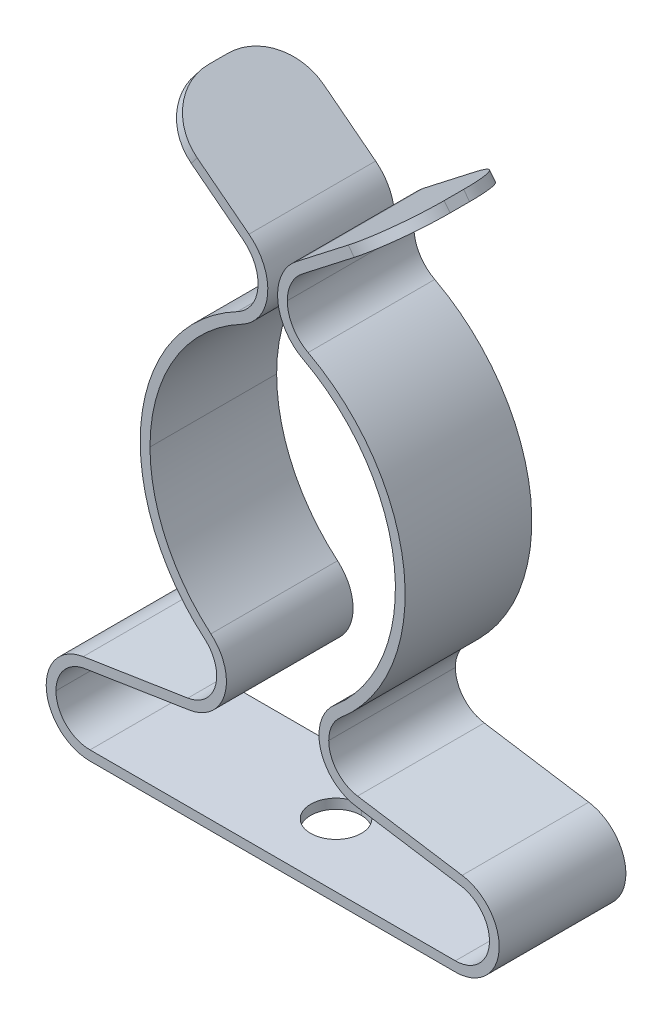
ISO-10303-21;
HEADER;
FILE_DESCRIPTION(('STEP AP214'),'2;1');
FILE_NAME('part.step','',(''),(''),'','','');
FILE_SCHEMA(('AUTOMOTIVE_DESIGN { 1 0 10303 214 1 1 1 1 }'));
ENDSEC;
DATA;
#1=APPLICATION_CONTEXT('core data for automotive mechanical design processes');
#2=APPLICATION_PROTOCOL_DEFINITION('international standard','automotive_design',2000,#1);
#3=PRODUCT_CONTEXT('',#1,'mechanical');
#4=PRODUCT('Part','Part','',(#3));
#5=PRODUCT_RELATED_PRODUCT_CATEGORY('part','',(#4));
#6=PRODUCT_DEFINITION_FORMATION('','',#4);
#7=PRODUCT_DEFINITION_CONTEXT('part definition',#1,'design');
#8=PRODUCT_DEFINITION('design','',#6,#7);
#9=PRODUCT_DEFINITION_SHAPE('','',#8);
#10=(LENGTH_UNIT() NAMED_UNIT(*) SI_UNIT(.MILLI.,.METRE.));
#11=(NAMED_UNIT(*) PLANE_ANGLE_UNIT() SI_UNIT($,.RADIAN.));
#12=(NAMED_UNIT(*) SI_UNIT($,.STERADIAN.) SOLID_ANGLE_UNIT());
#13=UNCERTAINTY_MEASURE_WITH_UNIT(LENGTH_MEASURE(1.E-05),#10,'distance_accuracy_value','');
#14=(GEOMETRIC_REPRESENTATION_CONTEXT(3) GLOBAL_UNCERTAINTY_ASSIGNED_CONTEXT((#13)) GLOBAL_UNIT_ASSIGNED_CONTEXT((#10,
#11,#12)) REPRESENTATION_CONTEXT('',''));
#15=CARTESIAN_POINT('',(0.,0.,0.));
#16=DIRECTION('',(0.,0.,1.));
#17=DIRECTION('',(1.,0.,0.));
#18=AXIS2_PLACEMENT_3D('',#15,#16,#17);
#19=CARTESIAN_POINT('',(0.,5.,0.));
#20=DIRECTION('',(0.,1.,0.));
#21=DIRECTION('',(0.,0.,1.));
#22=AXIS2_PLACEMENT_3D('',#19,#20,#21);
#23=CYLINDRICAL_SURFACE('',#22,2.6);
#24=DIRECTION('',(0.,1.,0.));
#25=VECTOR('',#24,1.);
#26=CARTESIAN_POINT('',(0.,5.,-2.6));
#27=LINE('',#26,#25);
#28=CARTESIAN_POINT('',(0.,-1.,-2.6));
#29=VERTEX_POINT('',#28);
#30=CARTESIAN_POINT('',(0.,0.,-2.6));
#31=VERTEX_POINT('',#30);
#32=EDGE_CURVE('E820',#29,#31,#27,.T.);
#33=ORIENTED_EDGE('',*,*,#32,.F.);
#34=CARTESIAN_POINT('',(0.,-1.,0.));
#35=DIRECTION('',(0.,1.,0.));
#36=DIRECTION('',(0.,0.,1.));
#37=AXIS2_PLACEMENT_3D('',#34,#35,#36);
#38=CIRCLE('',#37,2.6);
#39=CARTESIAN_POINT('',(0.,-1.,2.6));
#40=VERTEX_POINT('',#39);
#41=EDGE_CURVE('E452',#40,#29,#38,.T.);
#42=ORIENTED_EDGE('',*,*,#41,.F.);
#43=DIRECTION('',(0.,1.,0.));
#44=VECTOR('',#43,1.);
#45=CARTESIAN_POINT('',(0.,5.,2.6));
#46=LINE('',#45,#44);
#47=CARTESIAN_POINT('',(0.,0.,2.6));
#48=VERTEX_POINT('',#47);
#49=EDGE_CURVE('E817',#40,#48,#46,.T.);
#50=ORIENTED_EDGE('',*,*,#49,.T.);
#51=CARTESIAN_POINT('',(0.,0.,0.));
#52=DIRECTION('',(0.,1.,0.));
#53=DIRECTION('',(0.,0.,1.));
#54=AXIS2_PLACEMENT_3D('',#51,#52,#53);
#55=CIRCLE('',#54,2.6);
#56=EDGE_CURVE('E590',#48,#31,#55,.T.);
#57=ORIENTED_EDGE('',*,*,#56,.T.);
#58=EDGE_LOOP('',(#33,#42,#50,#57));
#59=FACE_BOUND('',#58,.T.);
#60=ADVANCED_FACE('F15',(#59),#23,.F.);
#61=CARTESIAN_POINT('',(7.7547229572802,58.1282693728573,1.));
#62=DIRECTION('',(-0.613041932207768,0.7900503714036,0.));
#63=DIRECTION('',(-0.7900503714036,-0.613041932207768,0.));
#64=AXIS2_PLACEMENT_3D('',#61,#62,#63);
#65=CYLINDRICAL_SURFACE('',#64,5.5);
#66=CARTESIAN_POINT('',(7.75472295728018,58.1282693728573,1.));
#67=DIRECTION('',(-0.613041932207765,0.790050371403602,0.));
#68=DIRECTION('',(-0.790050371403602,-0.613041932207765,0.));
#69=AXIS2_PLACEMENT_3D('',#66,#67,#68);
#70=CIRCLE('',#69,5.5);
#71=CARTESIAN_POINT('',(7.75472295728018,58.1282693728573,6.5));
#72=VERTEX_POINT('',#71);
#73=CARTESIAN_POINT('',(12.1,61.5,1.));
#74=VERTEX_POINT('',#73);
#75=EDGE_CURVE('E509',#72,#74,#70,.T.);
#76=ORIENTED_EDGE('',*,*,#75,.F.);
#77=DIRECTION('',(-0.613041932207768,0.790050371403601,0.));
#78=VECTOR('',#77,1.);
#79=CARTESIAN_POINT('',(7.7547229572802,58.1282693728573,6.5));
#80=LINE('',#79,#78);
#81=CARTESIAN_POINT('',(8.36776488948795,57.3382190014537,6.5));
#82=VERTEX_POINT('',#81);
#83=EDGE_CURVE('E642',#82,#72,#80,.T.);
#84=ORIENTED_EDGE('',*,*,#83,.F.);
#85=CARTESIAN_POINT('',(8.36776488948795,57.3382190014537,1.));
#86=DIRECTION('',(0.613041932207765,-0.790050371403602,0.));
#87=DIRECTION('',(-0.790050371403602,-0.613041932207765,0.));
#88=AXIS2_PLACEMENT_3D('',#85,#86,#87);
#89=CIRCLE('',#88,5.5);
#90=CARTESIAN_POINT('',(12.7130419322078,60.7099496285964,1.));
#91=VERTEX_POINT('',#90);
#92=EDGE_CURVE('E413',#91,#82,#89,.T.);
#93=ORIENTED_EDGE('',*,*,#92,.F.);
#94=DIRECTION('',(0.613041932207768,-0.790050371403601,0.));
#95=VECTOR('',#94,1.);
#96=CARTESIAN_POINT('',(12.7130419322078,60.7099496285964,1.));
#97=LINE('',#96,#95);
#98=EDGE_CURVE('E485',#74,#91,#97,.T.);
#99=ORIENTED_EDGE('',*,*,#98,.F.);
#100=EDGE_LOOP('',(#76,#84,#93,#99));
#101=FACE_BOUND('',#100,.T.);
#102=ADVANCED_FACE('F933',(#101),#65,.T.);
#103=CARTESIAN_POINT('',(10.819932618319,54.1780175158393,-1.));
#104=DIRECTION('',(0.613041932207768,-0.7900503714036,0.));
#105=DIRECTION('',(0.7900503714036,0.613041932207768,0.));
#106=AXIS2_PLACEMENT_3D('',#103,#104,#105);
#107=CYLINDRICAL_SURFACE('',#106,5.5);
#108=CARTESIAN_POINT('',(7.75472295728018,58.1282693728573,-1.));
#109=DIRECTION('',(-0.613041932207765,0.790050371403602,0.));
#110=DIRECTION('',(-0.790050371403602,-0.613041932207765,0.));
#111=AXIS2_PLACEMENT_3D('',#108,#109,#110);
#112=CIRCLE('',#111,5.5);
#113=CARTESIAN_POINT('',(12.1,61.5,-1.));
#114=VERTEX_POINT('',#113);
#115=CARTESIAN_POINT('',(7.75472295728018,58.1282693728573,-6.5));
#116=VERTEX_POINT('',#115);
#117=EDGE_CURVE('E488',#114,#116,#112,.T.);
#118=ORIENTED_EDGE('',*,*,#117,.F.);
#119=DIRECTION('',(-0.613041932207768,0.790050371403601,0.));
#120=VECTOR('',#119,1.);
#121=CARTESIAN_POINT('',(12.1,61.5,-1.));
#122=LINE('',#121,#120);
#123=CARTESIAN_POINT('',(12.7130419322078,60.7099496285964,-1.));
#124=VERTEX_POINT('',#123);
#125=EDGE_CURVE('E474',#124,#114,#122,.T.);
#126=ORIENTED_EDGE('',*,*,#125,.F.);
#127=CARTESIAN_POINT('',(8.36776488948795,57.3382190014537,-1.));
#128=DIRECTION('',(0.613041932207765,-0.790050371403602,0.));
#129=DIRECTION('',(-0.790050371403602,-0.613041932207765,0.));
#130=AXIS2_PLACEMENT_3D('',#127,#128,#129);
#131=CIRCLE('',#130,5.5);
#132=CARTESIAN_POINT('',(8.36776488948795,57.3382190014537,-6.5));
#133=VERTEX_POINT('',#132);
#134=EDGE_CURVE('E414',#133,#124,#131,.T.);
#135=ORIENTED_EDGE('',*,*,#134,.F.);
#136=DIRECTION('',(0.613041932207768,-0.790050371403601,0.));
#137=VECTOR('',#136,1.);
#138=CARTESIAN_POINT('',(10.819932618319,54.1780175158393,-6.5));
#139=LINE('',#138,#137);
#140=EDGE_CURVE('E9',#116,#133,#139,.T.);
#141=ORIENTED_EDGE('',*,*,#140,.F.);
#142=EDGE_LOOP('',(#118,#126,#135,#141));
#143=FACE_BOUND('',#142,.T.);
#144=ADVANCED_FACE('F937',(#143),#107,.T.);
#145=CARTESIAN_POINT('',(-8.36776488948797,57.3382190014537,1.));
#146=DIRECTION('',(-0.613041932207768,-0.7900503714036,0.));
#147=DIRECTION('',(0.7900503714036,-0.613041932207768,0.));
#148=AXIS2_PLACEMENT_3D('',#145,#146,#147);
#149=CYLINDRICAL_SURFACE('',#148,5.5);
#150=CARTESIAN_POINT('',(-8.36776488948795,57.3382190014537,1.));
#151=DIRECTION('',(-0.613041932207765,-0.790050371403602,0.));
#152=DIRECTION('',(-0.790050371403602,0.613041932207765,0.));
#153=AXIS2_PLACEMENT_3D('',#150,#151,#152);
#154=CIRCLE('',#153,5.5);
#155=CARTESIAN_POINT('',(-8.36776488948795,57.3382190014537,6.5));
#156=VERTEX_POINT('',#155);
#157=CARTESIAN_POINT('',(-12.7130419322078,60.7099496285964,1.));
#158=VERTEX_POINT('',#157);
#159=EDGE_CURVE('E641',#156,#158,#154,.T.);
#160=ORIENTED_EDGE('',*,*,#159,.F.);
#161=DIRECTION('',(-0.613041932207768,-0.790050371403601,0.));
#162=VECTOR('',#161,1.);
#163=CARTESIAN_POINT('',(-8.36776488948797,57.3382190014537,6.5));
#164=LINE('',#163,#162);
#165=CARTESIAN_POINT('',(-7.75472295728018,58.1282693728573,6.5));
#166=VERTEX_POINT('',#165);
#167=EDGE_CURVE('E633',#166,#156,#164,.T.);
#168=ORIENTED_EDGE('',*,*,#167,.F.);
#169=CARTESIAN_POINT('',(-7.75472295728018,58.1282693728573,1.));
#170=DIRECTION('',(0.613041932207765,0.790050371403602,0.));
#171=DIRECTION('',(-0.790050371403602,0.613041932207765,0.));
#172=AXIS2_PLACEMENT_3D('',#169,#170,#171);
#173=CIRCLE('',#172,5.5);
#174=CARTESIAN_POINT('',(-12.1,61.5,1.));
#175=VERTEX_POINT('',#174);
#176=EDGE_CURVE('E906',#175,#166,#173,.T.);
#177=ORIENTED_EDGE('',*,*,#176,.F.);
#178=DIRECTION('',(0.613041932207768,0.790050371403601,0.));
#179=VECTOR('',#178,1.);
#180=CARTESIAN_POINT('',(-12.1,61.5,1.));
#181=LINE('',#180,#179);
#182=EDGE_CURVE('E545',#158,#175,#181,.T.);
#183=ORIENTED_EDGE('',*,*,#182,.F.);
#184=EDGE_LOOP('',(#160,#168,#177,#183));
#185=FACE_BOUND('',#184,.T.);
#186=ADVANCED_FACE('F943',(#185),#149,.T.);
#187=CARTESIAN_POINT('',(-6.68590810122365,59.5056915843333,-1.));
#188=DIRECTION('',(0.613041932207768,0.7900503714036,0.));
#189=DIRECTION('',(-0.7900503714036,0.613041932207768,0.));
#190=AXIS2_PLACEMENT_3D('',#187,#188,#189);
#191=CYLINDRICAL_SURFACE('',#190,5.5);
#192=CARTESIAN_POINT('',(-8.36776488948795,57.3382190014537,-1.));
#193=DIRECTION('',(-0.613041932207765,-0.790050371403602,0.));
#194=DIRECTION('',(-0.790050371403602,0.613041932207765,0.));
#195=AXIS2_PLACEMENT_3D('',#192,#193,#194);
#196=CIRCLE('',#195,5.5);
#197=CARTESIAN_POINT('',(-12.7130419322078,60.7099496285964,-1.));
#198=VERTEX_POINT('',#197);
#199=CARTESIAN_POINT('',(-8.36776488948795,57.3382190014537,-6.5));
#200=VERTEX_POINT('',#199);
#201=EDGE_CURVE('E555',#198,#200,#196,.T.);
#202=ORIENTED_EDGE('',*,*,#201,.F.);
#203=DIRECTION('',(-0.613041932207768,-0.790050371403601,0.));
#204=VECTOR('',#203,1.);
#205=CARTESIAN_POINT('',(-12.7130419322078,60.7099496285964,-1.));
#206=LINE('',#205,#204);
#207=CARTESIAN_POINT('',(-12.1,61.5,-1.));
#208=VERTEX_POINT('',#207);
#209=EDGE_CURVE('E546',#208,#198,#206,.T.);
#210=ORIENTED_EDGE('',*,*,#209,.F.);
#211=CARTESIAN_POINT('',(-7.75472295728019,58.1282693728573,-1.));
#212=DIRECTION('',(0.613041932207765,0.790050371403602,0.));
#213=DIRECTION('',(-0.790050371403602,0.613041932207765,0.));
#214=AXIS2_PLACEMENT_3D('',#211,#212,#213);
#215=CIRCLE('',#214,5.5);
#216=CARTESIAN_POINT('',(-7.75472295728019,58.1282693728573,-6.5));
#217=VERTEX_POINT('',#216);
#218=EDGE_CURVE('E519',#217,#208,#215,.T.);
#219=ORIENTED_EDGE('',*,*,#218,.F.);
#220=DIRECTION('',(0.613041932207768,0.790050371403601,0.));
#221=VECTOR('',#220,1.);
#222=CARTESIAN_POINT('',(-6.68590810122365,59.5056915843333,-6.5));
#223=LINE('',#222,#221);
#224=EDGE_CURVE('E24',#200,#217,#223,.T.);
#225=ORIENTED_EDGE('',*,*,#224,.F.);
#226=EDGE_LOOP('',(#202,#210,#219,#225));
#227=FACE_BOUND('',#226,.T.);
#228=ADVANCED_FACE('F692',(#227),#191,.T.);
#229=CARTESIAN_POINT('',(5.5,50.05,-6.5));
#230=DIRECTION('',(0.,0.,-1.));
#231=DIRECTION('',(0.,-1.,0.));
#232=AXIS2_PLACEMENT_3D('',#229,#230,#231);
#233=PLANE('',#232);
#234=DIRECTION('',(0.790050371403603,-0.613041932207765,0.));
#235=VECTOR('',#234,1.);
#236=CARTESIAN_POINT('',(-3.04783227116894,53.2102014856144,-6.5));
#237=LINE('',#236,#235);
#238=CARTESIAN_POINT('',(-3.04783227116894,53.2102014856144,-6.5));
#239=VERTEX_POINT('',#238);
#240=EDGE_CURVE('E559',#200,#239,#237,.T.);
#241=ORIENTED_EDGE('',*,*,#240,.F.);
#242=ORIENTED_EDGE('',*,*,#224,.T.);
#243=DIRECTION('',(0.790050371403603,-0.613041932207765,0.));
#244=VECTOR('',#243,1.);
#245=CARTESIAN_POINT('',(-2.43479033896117,54.000251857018,-6.5));
#246=LINE('',#245,#244);
#247=CARTESIAN_POINT('',(-2.43479033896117,54.000251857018,-6.5));
#248=VERTEX_POINT('',#247);
#249=EDGE_CURVE('E524',#217,#248,#246,.T.);
#250=ORIENTED_EDGE('',*,*,#249,.T.);
#251=CARTESIAN_POINT('',(-5.5,50.05,-6.5));
#252=DIRECTION('',(0.,0.,-1.));
#253=DIRECTION('',(1.,0.,0.));
#254=AXIS2_PLACEMENT_3D('',#251,#252,#253);
#255=CIRCLE('',#254,5.);
#256=CARTESIAN_POINT('',(-3.16810397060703,45.6270755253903,-6.5));
#257=VERTEX_POINT('',#256);
#258=EDGE_CURVE('E618',#248,#257,#255,.T.);
#259=ORIENTED_EDGE('',*,*,#258,.T.);
#260=CARTESIAN_POINT('',(5.07095043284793,30.,-6.5));
#261=DIRECTION('',(0.,0.,1.));
#262=DIRECTION('',(-1.,0.,0.));
#263=AXIS2_PLACEMENT_3D('',#260,#261,#262);
#264=CIRCLE('',#263,17.6659986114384);
#265=CARTESIAN_POINT('',(-12.5950481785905,30.,-6.5));
#266=VERTEX_POINT('',#265);
#267=EDGE_CURVE('E711',#257,#266,#264,.T.);
#268=ORIENTED_EDGE('',*,*,#267,.T.);
#269=CARTESIAN_POINT('',(5.07095043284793,30.,-6.5));
#270=DIRECTION('',(0.,0.,1.));
#271=DIRECTION('',(-1.,0.,0.));
#272=AXIS2_PLACEMENT_3D('',#269,#270,#271);
#273=CIRCLE('',#272,17.6659986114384);
#274=CARTESIAN_POINT('',(-6.3426517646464,16.5160394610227,-6.5));
#275=VERTEX_POINT('',#274);
#276=EDGE_CURVE('E615',#266,#275,#273,.T.);
#277=ORIENTED_EDGE('',*,*,#276,.T.);
#278=CARTESIAN_POINT('',(-9.25,13.0813158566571,-6.5));
#279=DIRECTION('',(0.,0.,-1.));
#280=DIRECTION('',(1.,0.,0.));
#281=AXIS2_PLACEMENT_3D('',#278,#279,#280);
#282=CIRCLE('',#281,4.5);
#283=CARTESIAN_POINT('',(-8.55535518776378,8.63525371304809,-6.5));
#284=VERTEX_POINT('',#283);
#285=EDGE_CURVE('E425',#275,#284,#282,.T.);
#286=ORIENTED_EDGE('',*,*,#285,.T.);
#287=DIRECTION('',(-0.988013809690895,-0.154365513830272,0.));
#288=VECTOR('',#287,1.);
#289=CARTESIAN_POINT('',(-19.2902792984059,6.95804833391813,-6.5));
#290=LINE('',#289,#288);
#291=CARTESIAN_POINT('',(-19.2902792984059,6.95804833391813,-6.5));
#292=VERTEX_POINT('',#291);
#293=EDGE_CURVE('E599',#284,#292,#290,.T.);
#294=ORIENTED_EDGE('',*,*,#293,.T.);
#295=CARTESIAN_POINT('',(-18.75,3.5,-6.5));
#296=DIRECTION('',(0.,0.,1.));
#297=DIRECTION('',(-1.,0.,0.));
#298=AXIS2_PLACEMENT_3D('',#295,#296,#297);
#299=CIRCLE('',#298,3.5);
#300=CARTESIAN_POINT('',(-22.25,3.5,-6.5));
#301=VERTEX_POINT('',#300);
#302=EDGE_CURVE('E744',#292,#301,#299,.T.);
#303=ORIENTED_EDGE('',*,*,#302,.T.);
#304=CARTESIAN_POINT('',(-18.75,3.5,-6.5));
#305=DIRECTION('',(0.,0.,1.));
#306=DIRECTION('',(-1.,0.,0.));
#307=AXIS2_PLACEMENT_3D('',#304,#305,#306);
#308=CIRCLE('',#307,3.5);
#309=CARTESIAN_POINT('',(-18.75,0.,-6.5));
#310=VERTEX_POINT('',#309);
#311=EDGE_CURVE('E596',#301,#310,#308,.T.);
#312=ORIENTED_EDGE('',*,*,#311,.T.);
#313=DIRECTION('',(1.,0.,0.));
#314=VECTOR('',#313,1.);
#315=CARTESIAN_POINT('',(-18.75,0.,-6.5));
#316=LINE('',#315,#314);
#317=CARTESIAN_POINT('',(18.75,0.,-6.5));
#318=VERTEX_POINT('',#317);
#319=EDGE_CURVE('E577',#310,#318,#316,.T.);
#320=ORIENTED_EDGE('',*,*,#319,.T.);
#321=CARTESIAN_POINT('',(18.75,3.5,-6.5));
#322=DIRECTION('',(0.,0.,1.));
#323=DIRECTION('',(1.,0.,0.));
#324=AXIS2_PLACEMENT_3D('',#321,#322,#323);
#325=CIRCLE('',#324,3.5);
#326=CARTESIAN_POINT('',(19.2902792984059,6.95804833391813,-6.5));
#327=VERTEX_POINT('',#326);
#328=EDGE_CURVE('E570',#318,#327,#325,.T.);
#329=ORIENTED_EDGE('',*,*,#328,.T.);
#330=DIRECTION('',(-0.988013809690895,0.154365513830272,0.));
#331=VECTOR('',#330,1.);
#332=CARTESIAN_POINT('',(19.2902792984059,6.95804833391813,-6.5));
#333=LINE('',#332,#331);
#334=CARTESIAN_POINT('',(8.55535518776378,8.63525371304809,-6.5));
#335=VERTEX_POINT('',#334);
#336=EDGE_CURVE('E549',#327,#335,#333,.T.);
#337=ORIENTED_EDGE('',*,*,#336,.T.);
#338=CARTESIAN_POINT('',(9.25,13.0813158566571,-6.5));
#339=DIRECTION('',(0.,0.,-1.));
#340=DIRECTION('',(-1.,0.,0.));
#341=AXIS2_PLACEMENT_3D('',#338,#339,#340);
#342=CIRCLE('',#341,4.5);
#343=CARTESIAN_POINT('',(4.75,13.0813158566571,-6.5));
#344=VERTEX_POINT('',#343);
#345=EDGE_CURVE('E419',#335,#344,#342,.T.);
#346=ORIENTED_EDGE('',*,*,#345,.T.);
#347=CARTESIAN_POINT('',(9.25,13.0813158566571,-6.5));
#348=DIRECTION('',(0.,0.,-1.));
#349=DIRECTION('',(-1.,0.,0.));
#350=AXIS2_PLACEMENT_3D('',#347,#348,#349);
#351=CIRCLE('',#350,4.5);
#352=CARTESIAN_POINT('',(6.34265176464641,16.5160394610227,-6.5));
#353=VERTEX_POINT('',#352);
#354=EDGE_CURVE('E540',#344,#353,#351,.T.);
#355=ORIENTED_EDGE('',*,*,#354,.T.);
#356=CARTESIAN_POINT('',(-5.07095043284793,30.,-6.5));
#357=DIRECTION('',(0.,0.,1.));
#358=DIRECTION('',(1.,0.,0.));
#359=AXIS2_PLACEMENT_3D('',#356,#357,#358);
#360=CIRCLE('',#359,17.6659986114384);
#361=CARTESIAN_POINT('',(3.16810397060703,45.6270755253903,-6.5));
#362=VERTEX_POINT('',#361);
#363=EDGE_CURVE('E527',#353,#362,#360,.T.);
#364=ORIENTED_EDGE('',*,*,#363,.T.);
#365=CARTESIAN_POINT('',(5.5,50.05,-6.5));
#366=DIRECTION('',(0.,0.,-1.));
#367=DIRECTION('',(-1.,0.,0.));
#368=AXIS2_PLACEMENT_3D('',#365,#366,#367);
#369=CIRCLE('',#368,5.);
#370=CARTESIAN_POINT('',(0.499999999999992,50.05,-6.5));
#371=VERTEX_POINT('',#370);
#372=EDGE_CURVE('E451',#362,#371,#369,.T.);
#373=ORIENTED_EDGE('',*,*,#372,.T.);
#374=CARTESIAN_POINT('',(5.5,50.05,-6.5));
#375=DIRECTION('',(0.,0.,-1.));
#376=DIRECTION('',(-1.,0.,0.));
#377=AXIS2_PLACEMENT_3D('',#374,#375,#376);
#378=CIRCLE('',#377,5.);
#379=CARTESIAN_POINT('',(2.43479033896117,54.000251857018,-6.5));
#380=VERTEX_POINT('',#379);
#381=EDGE_CURVE('E515',#371,#380,#378,.T.);
#382=ORIENTED_EDGE('',*,*,#381,.T.);
#383=DIRECTION('',(0.790050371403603,0.613041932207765,0.));
#384=VECTOR('',#383,1.);
#385=CARTESIAN_POINT('',(2.43479033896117,54.000251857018,-6.5));
#386=LINE('',#385,#384);
#387=EDGE_CURVE('E493',#380,#116,#386,.T.);
#388=ORIENTED_EDGE('',*,*,#387,.T.);
#389=ORIENTED_EDGE('',*,*,#140,.T.);
#390=DIRECTION('',(0.790050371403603,0.613041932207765,0.));
#391=VECTOR('',#390,1.);
#392=CARTESIAN_POINT('',(3.04783227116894,53.2102014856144,-6.5));
#393=LINE('',#392,#391);
#394=CARTESIAN_POINT('',(3.04783227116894,53.2102014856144,-6.5));
#395=VERTEX_POINT('',#394);
#396=EDGE_CURVE('E435',#395,#133,#393,.T.);
#397=ORIENTED_EDGE('',*,*,#396,.F.);
#398=CARTESIAN_POINT('',(5.5,50.05,-6.5));
#399=DIRECTION('',(0.,0.,-1.));
#400=DIRECTION('',(1.,0.,0.));
#401=AXIS2_PLACEMENT_3D('',#398,#399,#400);
#402=CIRCLE('',#401,4.);
#403=CARTESIAN_POINT('',(1.5,50.05,-6.5));
#404=VERTEX_POINT('',#403);
#405=EDGE_CURVE('E862',#404,#395,#402,.T.);
#406=ORIENTED_EDGE('',*,*,#405,.F.);
#407=CARTESIAN_POINT('',(5.5,50.05,-6.5));
#408=DIRECTION('',(0.,0.,-1.));
#409=DIRECTION('',(1.,0.,0.));
#410=AXIS2_PLACEMENT_3D('',#407,#408,#409);
#411=CIRCLE('',#410,4.);
#412=CARTESIAN_POINT('',(3.63448317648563,46.5116604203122,-6.5));
#413=VERTEX_POINT('',#412);
#414=EDGE_CURVE('E630',#413,#404,#411,.T.);
#415=ORIENTED_EDGE('',*,*,#414,.F.);
#416=CARTESIAN_POINT('',(-5.07095043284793,30.,-6.5));
#417=DIRECTION('',(0.,0.,1.));
#418=DIRECTION('',(1.,0.,0.));
#419=AXIS2_PLACEMENT_3D('',#416,#417,#418);
#420=CIRCLE('',#419,18.6659986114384);
#421=CARTESIAN_POINT('',(6.98872915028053,15.7527675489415,-6.5));
#422=VERTEX_POINT('',#421);
#423=EDGE_CURVE('E424',#422,#413,#420,.T.);
#424=ORIENTED_EDGE('',*,*,#423,.F.);
#425=CARTESIAN_POINT('',(9.25,13.0813158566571,-6.5));
#426=DIRECTION('',(0.,0.,-1.));
#427=DIRECTION('',(1.,0.,0.));
#428=AXIS2_PLACEMENT_3D('',#425,#426,#427);
#429=CIRCLE('',#428,3.5);
#430=CARTESIAN_POINT('',(5.75,13.0813158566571,-6.5));
#431=VERTEX_POINT('',#430);
#432=EDGE_CURVE('E842',#431,#422,#429,.T.);
#433=ORIENTED_EDGE('',*,*,#432,.F.);
#434=CARTESIAN_POINT('',(9.25,13.0813158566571,-6.5));
#435=DIRECTION('',(0.,0.,-1.));
#436=DIRECTION('',(1.,0.,0.));
#437=AXIS2_PLACEMENT_3D('',#434,#435,#436);
#438=CIRCLE('',#437,3.5);
#439=CARTESIAN_POINT('',(8.70972070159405,9.62326752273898,-6.5));
#440=VERTEX_POINT('',#439);
#441=EDGE_CURVE('E215',#440,#431,#438,.T.);
#442=ORIENTED_EDGE('',*,*,#441,.F.);
#443=DIRECTION('',(-0.988013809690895,0.154365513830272,0.));
#444=VECTOR('',#443,1.);
#445=CARTESIAN_POINT('',(19.4446448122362,7.94606214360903,-6.5));
#446=LINE('',#445,#444);
#447=CARTESIAN_POINT('',(19.4446448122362,7.94606214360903,-6.5));
#448=VERTEX_POINT('',#447);
#449=EDGE_CURVE('E580',#448,#440,#446,.T.);
#450=ORIENTED_EDGE('',*,*,#449,.F.);
#451=CARTESIAN_POINT('',(18.75,3.5,-6.5));
#452=DIRECTION('',(0.,0.,1.));
#453=DIRECTION('',(1.,0.,0.));
#454=AXIS2_PLACEMENT_3D('',#451,#452,#453);
#455=CIRCLE('',#454,4.5);
#456=CARTESIAN_POINT('',(18.75,-1.,-6.5));
#457=VERTEX_POINT('',#456);
#458=EDGE_CURVE('E456',#457,#448,#455,.T.);
#459=ORIENTED_EDGE('',*,*,#458,.F.);
#460=DIRECTION('',(1.,0.,0.));
#461=VECTOR('',#460,1.);
#462=CARTESIAN_POINT('',(-18.75,-1.,-6.5));
#463=LINE('',#462,#461);
#464=CARTESIAN_POINT('',(-18.75,-1.,-6.5));
#465=VERTEX_POINT('',#464);
#466=EDGE_CURVE('E382',#465,#457,#463,.T.);
#467=ORIENTED_EDGE('',*,*,#466,.F.);
#468=CARTESIAN_POINT('',(-18.75,3.5,-6.5));
#469=DIRECTION('',(0.,0.,1.));
#470=DIRECTION('',(1.,0.,0.));
#471=AXIS2_PLACEMENT_3D('',#468,#469,#470);
#472=CIRCLE('',#471,4.5);
#473=CARTESIAN_POINT('',(-23.25,3.5,-6.5));
#474=VERTEX_POINT('',#473);
#475=EDGE_CURVE('E377',#474,#465,#472,.T.);
#476=ORIENTED_EDGE('',*,*,#475,.F.);
#477=CARTESIAN_POINT('',(-18.75,3.5,-6.5));
#478=DIRECTION('',(0.,0.,1.));
#479=DIRECTION('',(1.,0.,0.));
#480=AXIS2_PLACEMENT_3D('',#477,#478,#479);
#481=CIRCLE('',#480,4.5);
#482=CARTESIAN_POINT('',(-19.4446448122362,7.94606214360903,-6.5));
#483=VERTEX_POINT('',#482);
#484=EDGE_CURVE('E369',#483,#474,#481,.T.);
#485=ORIENTED_EDGE('',*,*,#484,.F.);
#486=DIRECTION('',(-0.988013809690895,-0.154365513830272,0.));
#487=VECTOR('',#486,1.);
#488=CARTESIAN_POINT('',(-19.4446448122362,7.94606214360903,-6.5));
#489=LINE('',#488,#487);
#490=CARTESIAN_POINT('',(-8.70972070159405,9.62326752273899,-6.5));
#491=VERTEX_POINT('',#490);
#492=EDGE_CURVE('E374',#491,#483,#489,.T.);
#493=ORIENTED_EDGE('',*,*,#492,.F.);
#494=CARTESIAN_POINT('',(-9.25,13.0813158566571,-6.5));
#495=DIRECTION('',(0.,0.,-1.));
#496=DIRECTION('',(1.,0.,0.));
#497=AXIS2_PLACEMENT_3D('',#494,#495,#496);
#498=CIRCLE('',#497,3.5);
#499=CARTESIAN_POINT('',(-6.98872915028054,15.7527675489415,-6.5));
#500=VERTEX_POINT('',#499);
#501=EDGE_CURVE('E477',#500,#491,#498,.T.);
#502=ORIENTED_EDGE('',*,*,#501,.F.);
#503=CARTESIAN_POINT('',(5.07095043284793,30.,-6.5));
#504=DIRECTION('',(0.,0.,1.));
#505=DIRECTION('',(1.,0.,0.));
#506=AXIS2_PLACEMENT_3D('',#503,#504,#505);
#507=CIRCLE('',#506,18.6659986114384);
#508=CARTESIAN_POINT('',(-13.5950481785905,30.,-6.5));
#509=VERTEX_POINT('',#508);
#510=EDGE_CURVE('E910',#509,#500,#507,.T.);
#511=ORIENTED_EDGE('',*,*,#510,.F.);
#512=CARTESIAN_POINT('',(5.07095043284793,30.,-6.5));
#513=DIRECTION('',(0.,0.,1.));
#514=DIRECTION('',(1.,0.,0.));
#515=AXIS2_PLACEMENT_3D('',#512,#513,#514);
#516=CIRCLE('',#515,18.6659986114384);
#517=CARTESIAN_POINT('',(-3.63448317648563,46.5116604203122,-6.5));
#518=VERTEX_POINT('',#517);
#519=EDGE_CURVE('E502',#518,#509,#516,.T.);
#520=ORIENTED_EDGE('',*,*,#519,.F.);
#521=CARTESIAN_POINT('',(-5.5,50.05,-6.5));
#522=DIRECTION('',(0.,0.,-1.));
#523=DIRECTION('',(1.,0.,0.));
#524=AXIS2_PLACEMENT_3D('',#521,#522,#523);
#525=CIRCLE('',#524,4.);
#526=EDGE_CURVE('E647',#239,#518,#525,.T.);
#527=ORIENTED_EDGE('',*,*,#526,.F.);
#528=EDGE_LOOP('',(#241,#242,#250,#259,#268,#277,#286,#294,#303,#312,#320,#329,#337,#346,#355,
#364,#373,#382,#388,#389,#397,#406,#415,#424,#433,#442,#450,#459,#467,#476,#485,#493,#502,#511,
#520,#527));
#529=FACE_BOUND('',#528,.T.);
#530=ADVANCED_FACE('F372',(#529),#233,.T.);
#531=CARTESIAN_POINT('',(5.5,50.05,6.5));
#532=DIRECTION('',(0.,0.,-1.));
#533=DIRECTION('',(0.,-1.,0.));
#534=AXIS2_PLACEMENT_3D('',#531,#532,#533);
#535=PLANE('',#534);
#536=DIRECTION('',(0.790050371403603,-0.613041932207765,0.));
#537=VECTOR('',#536,1.);
#538=CARTESIAN_POINT('',(-2.43479033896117,54.000251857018,6.5));
#539=LINE('',#538,#537);
#540=CARTESIAN_POINT('',(-2.43479033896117,54.000251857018,6.5));
#541=VERTEX_POINT('',#540);
#542=EDGE_CURVE('E702',#166,#541,#539,.T.);
#543=ORIENTED_EDGE('',*,*,#542,.F.);
#544=ORIENTED_EDGE('',*,*,#167,.T.);
#545=DIRECTION('',(0.790050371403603,-0.613041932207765,0.));
#546=VECTOR('',#545,1.);
#547=CARTESIAN_POINT('',(-3.04783227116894,53.2102014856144,6.5));
#548=LINE('',#547,#546);
#549=CARTESIAN_POINT('',(-3.04783227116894,53.2102014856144,6.5));
#550=VERTEX_POINT('',#549);
#551=EDGE_CURVE('E637',#156,#550,#548,.T.);
#552=ORIENTED_EDGE('',*,*,#551,.T.);
#553=CARTESIAN_POINT('',(-5.5,50.05,6.5));
#554=DIRECTION('',(0.,0.,-1.));
#555=DIRECTION('',(1.,0.,0.));
#556=AXIS2_PLACEMENT_3D('',#553,#554,#555);
#557=CIRCLE('',#556,4.);
#558=CARTESIAN_POINT('',(-3.63448317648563,46.5116604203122,6.5));
#559=VERTEX_POINT('',#558);
#560=EDGE_CURVE('E655',#550,#559,#557,.T.);
#561=ORIENTED_EDGE('',*,*,#560,.T.);
#562=CARTESIAN_POINT('',(5.07095043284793,30.,6.5));
#563=DIRECTION('',(0.,0.,1.));
#564=DIRECTION('',(1.,0.,0.));
#565=AXIS2_PLACEMENT_3D('',#562,#563,#564);
#566=CIRCLE('',#565,18.6659986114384);
#567=CARTESIAN_POINT('',(-13.5950481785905,30.,6.5));
#568=VERTEX_POINT('',#567);
#569=EDGE_CURVE('E505',#559,#568,#566,.T.);
#570=ORIENTED_EDGE('',*,*,#569,.T.);
#571=CARTESIAN_POINT('',(5.07095043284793,30.,6.5));
#572=DIRECTION('',(0.,0.,1.));
#573=DIRECTION('',(1.,0.,0.));
#574=AXIS2_PLACEMENT_3D('',#571,#572,#573);
#575=CIRCLE('',#574,18.6659986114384);
#576=CARTESIAN_POINT('',(-6.98872915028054,15.7527675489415,6.5));
#577=VERTEX_POINT('',#576);
#578=EDGE_CURVE('E897',#568,#577,#575,.T.);
#579=ORIENTED_EDGE('',*,*,#578,.T.);
#580=CARTESIAN_POINT('',(-9.25,13.0813158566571,6.5));
#581=DIRECTION('',(0.,0.,-1.));
#582=DIRECTION('',(1.,0.,0.));
#583=AXIS2_PLACEMENT_3D('',#580,#581,#582);
#584=CIRCLE('',#583,3.5);
#585=CARTESIAN_POINT('',(-8.70972070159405,9.62326752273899,6.5));
#586=VERTEX_POINT('',#585);
#587=EDGE_CURVE('E398',#577,#586,#584,.T.);
#588=ORIENTED_EDGE('',*,*,#587,.T.);
#589=DIRECTION('',(-0.988013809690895,-0.154365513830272,0.));
#590=VECTOR('',#589,1.);
#591=CARTESIAN_POINT('',(-19.4446448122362,7.94606214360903,6.5));
#592=LINE('',#591,#590);
#593=CARTESIAN_POINT('',(-19.4446448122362,7.94606214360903,6.5));
#594=VERTEX_POINT('',#593);
#595=EDGE_CURVE('E391',#586,#594,#592,.T.);
#596=ORIENTED_EDGE('',*,*,#595,.T.);
#597=CARTESIAN_POINT('',(-18.75,3.5,6.5));
#598=DIRECTION('',(0.,0.,1.));
#599=DIRECTION('',(1.,0.,0.));
#600=AXIS2_PLACEMENT_3D('',#597,#598,#599);
#601=CIRCLE('',#600,4.5);
#602=CARTESIAN_POINT('',(-23.25,3.5,6.5));
#603=VERTEX_POINT('',#602);
#604=EDGE_CURVE('E383',#594,#603,#601,.T.);
#605=ORIENTED_EDGE('',*,*,#604,.T.);
#606=CARTESIAN_POINT('',(-18.75,3.5,6.5));
#607=DIRECTION('',(0.,0.,1.));
#608=DIRECTION('',(1.,0.,0.));
#609=AXIS2_PLACEMENT_3D('',#606,#607,#608);
#610=CIRCLE('',#609,4.5);
#611=CARTESIAN_POINT('',(-18.75,-1.,6.5));
#612=VERTEX_POINT('',#611);
#613=EDGE_CURVE('E868',#603,#612,#610,.T.);
#614=ORIENTED_EDGE('',*,*,#613,.T.);
#615=DIRECTION('',(1.,0.,0.));
#616=VECTOR('',#615,1.);
#617=CARTESIAN_POINT('',(-18.75,-1.,6.5));
#618=LINE('',#617,#616);
#619=CARTESIAN_POINT('',(18.75,-1.,6.5));
#620=VERTEX_POINT('',#619);
#621=EDGE_CURVE('E457',#612,#620,#618,.T.);
#622=ORIENTED_EDGE('',*,*,#621,.T.);
#623=CARTESIAN_POINT('',(18.75,3.5,6.5));
#624=DIRECTION('',(0.,0.,1.));
#625=DIRECTION('',(1.,0.,0.));
#626=AXIS2_PLACEMENT_3D('',#623,#624,#625);
#627=CIRCLE('',#626,4.5);
#628=CARTESIAN_POINT('',(19.4446448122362,7.94606214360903,6.5));
#629=VERTEX_POINT('',#628);
#630=EDGE_CURVE('E518',#620,#629,#627,.T.);
#631=ORIENTED_EDGE('',*,*,#630,.T.);
#632=DIRECTION('',(-0.988013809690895,0.154365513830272,0.));
#633=VECTOR('',#632,1.);
#634=CARTESIAN_POINT('',(19.4446448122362,7.94606214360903,6.5));
#635=LINE('',#634,#633);
#636=CARTESIAN_POINT('',(8.70972070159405,9.62326752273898,6.5));
#637=VERTEX_POINT('',#636);
#638=EDGE_CURVE('E228',#629,#637,#635,.T.);
#639=ORIENTED_EDGE('',*,*,#638,.T.);
#640=CARTESIAN_POINT('',(9.25,13.0813158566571,6.5));
#641=DIRECTION('',(0.,0.,-1.));
#642=DIRECTION('',(1.,0.,0.));
#643=AXIS2_PLACEMENT_3D('',#640,#641,#642);
#644=CIRCLE('',#643,3.5);
#645=CARTESIAN_POINT('',(5.75,13.0813158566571,6.5));
#646=VERTEX_POINT('',#645);
#647=EDGE_CURVE('E681',#637,#646,#644,.T.);
#648=ORIENTED_EDGE('',*,*,#647,.T.);
#649=CARTESIAN_POINT('',(9.25,13.0813158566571,6.5));
#650=DIRECTION('',(0.,0.,-1.));
#651=DIRECTION('',(1.,0.,0.));
#652=AXIS2_PLACEMENT_3D('',#649,#650,#651);
#653=CIRCLE('',#652,3.5);
#654=CARTESIAN_POINT('',(6.98872915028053,15.7527675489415,6.5));
#655=VERTEX_POINT('',#654);
#656=EDGE_CURVE('E843',#646,#655,#653,.T.);
#657=ORIENTED_EDGE('',*,*,#656,.T.);
#658=CARTESIAN_POINT('',(-5.07095043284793,30.,6.5));
#659=DIRECTION('',(0.,0.,1.));
#660=DIRECTION('',(1.,0.,0.));
#661=AXIS2_PLACEMENT_3D('',#658,#659,#660);
#662=CIRCLE('',#661,18.6659986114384);
#663=CARTESIAN_POINT('',(3.63448317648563,46.5116604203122,6.5));
#664=VERTEX_POINT('',#663);
#665=EDGE_CURVE('E423',#655,#664,#662,.T.);
#666=ORIENTED_EDGE('',*,*,#665,.T.);
#667=CARTESIAN_POINT('',(5.5,50.05,6.5));
#668=DIRECTION('',(0.,0.,-1.));
#669=DIRECTION('',(1.,0.,0.));
#670=AXIS2_PLACEMENT_3D('',#667,#668,#669);
#671=CIRCLE('',#670,4.);
#672=CARTESIAN_POINT('',(1.5,50.05,6.5));
#673=VERTEX_POINT('',#672);
#674=EDGE_CURVE('E37',#664,#673,#671,.T.);
#675=ORIENTED_EDGE('',*,*,#674,.T.);
#676=CARTESIAN_POINT('',(5.5,50.05,6.5));
#677=DIRECTION('',(0.,0.,-1.));
#678=DIRECTION('',(1.,0.,0.));
#679=AXIS2_PLACEMENT_3D('',#676,#677,#678);
#680=CIRCLE('',#679,4.);
#681=CARTESIAN_POINT('',(3.04783227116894,53.2102014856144,6.5));
#682=VERTEX_POINT('',#681);
#683=EDGE_CURVE('E828',#673,#682,#680,.T.);
#684=ORIENTED_EDGE('',*,*,#683,.T.);
#685=DIRECTION('',(0.790050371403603,0.613041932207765,0.));
#686=VECTOR('',#685,1.);
#687=CARTESIAN_POINT('',(3.04783227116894,53.2102014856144,6.5));
#688=LINE('',#687,#686);
#689=EDGE_CURVE('E467',#682,#82,#688,.T.);
#690=ORIENTED_EDGE('',*,*,#689,.T.);
#691=ORIENTED_EDGE('',*,*,#83,.T.);
#692=DIRECTION('',(0.790050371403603,0.613041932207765,0.));
#693=VECTOR('',#692,1.);
#694=CARTESIAN_POINT('',(2.43479033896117,54.000251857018,6.5));
#695=LINE('',#694,#693);
#696=CARTESIAN_POINT('',(2.43479033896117,54.000251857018,6.5));
#697=VERTEX_POINT('',#696);
#698=EDGE_CURVE('E501',#697,#72,#695,.T.);
#699=ORIENTED_EDGE('',*,*,#698,.F.);
#700=CARTESIAN_POINT('',(5.5,50.05,6.5));
#701=DIRECTION('',(0.,0.,-1.));
#702=DIRECTION('',(-1.,0.,0.));
#703=AXIS2_PLACEMENT_3D('',#700,#701,#702);
#704=CIRCLE('',#703,5.);
#705=CARTESIAN_POINT('',(0.499999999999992,50.05,6.5));
#706=VERTEX_POINT('',#705);
#707=EDGE_CURVE('E512',#706,#697,#704,.T.);
#708=ORIENTED_EDGE('',*,*,#707,.F.);
#709=CARTESIAN_POINT('',(5.5,50.05,6.5));
#710=DIRECTION('',(0.,0.,-1.));
#711=DIRECTION('',(-1.,0.,0.));
#712=AXIS2_PLACEMENT_3D('',#709,#710,#711);
#713=CIRCLE('',#712,5.);
#714=CARTESIAN_POINT('',(3.16810397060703,45.6270755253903,6.5));
#715=VERTEX_POINT('',#714);
#716=EDGE_CURVE('E443',#715,#706,#713,.T.);
#717=ORIENTED_EDGE('',*,*,#716,.F.);
#718=CARTESIAN_POINT('',(-5.07095043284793,30.,6.5));
#719=DIRECTION('',(0.,0.,1.));
#720=DIRECTION('',(1.,0.,0.));
#721=AXIS2_PLACEMENT_3D('',#718,#719,#720);
#722=CIRCLE('',#721,17.6659986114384);
#723=CARTESIAN_POINT('',(6.34265176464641,16.5160394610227,6.5));
#724=VERTEX_POINT('',#723);
#725=EDGE_CURVE('E534',#724,#715,#722,.T.);
#726=ORIENTED_EDGE('',*,*,#725,.F.);
#727=CARTESIAN_POINT('',(9.25,13.0813158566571,6.5));
#728=DIRECTION('',(0.,0.,-1.));
#729=DIRECTION('',(-1.,0.,0.));
#730=AXIS2_PLACEMENT_3D('',#727,#728,#729);
#731=CIRCLE('',#730,4.5);
#732=CARTESIAN_POINT('',(4.75,13.0813158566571,6.5));
#733=VERTEX_POINT('',#732);
#734=EDGE_CURVE('E537',#733,#724,#731,.T.);
#735=ORIENTED_EDGE('',*,*,#734,.F.);
#736=CARTESIAN_POINT('',(9.25,13.0813158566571,6.5));
#737=DIRECTION('',(0.,0.,-1.));
#738=DIRECTION('',(-1.,0.,0.));
#739=AXIS2_PLACEMENT_3D('',#736,#737,#738);
#740=CIRCLE('',#739,4.5);
#741=CARTESIAN_POINT('',(8.55535518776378,8.63525371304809,6.5));
#742=VERTEX_POINT('',#741);
#743=EDGE_CURVE('E408',#742,#733,#740,.T.);
#744=ORIENTED_EDGE('',*,*,#743,.F.);
#745=DIRECTION('',(-0.988013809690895,0.154365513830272,0.));
#746=VECTOR('',#745,1.);
#747=CARTESIAN_POINT('',(19.2902792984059,6.95804833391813,6.5));
#748=LINE('',#747,#746);
#749=CARTESIAN_POINT('',(19.2902792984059,6.95804833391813,6.5));
#750=VERTEX_POINT('',#749);
#751=EDGE_CURVE('E563',#750,#742,#748,.T.);
#752=ORIENTED_EDGE('',*,*,#751,.F.);
#753=CARTESIAN_POINT('',(18.75,3.5,6.5));
#754=DIRECTION('',(0.,0.,1.));
#755=DIRECTION('',(1.,0.,0.));
#756=AXIS2_PLACEMENT_3D('',#753,#754,#755);
#757=CIRCLE('',#756,3.5);
#758=CARTESIAN_POINT('',(18.75,0.,6.5));
#759=VERTEX_POINT('',#758);
#760=EDGE_CURVE('E574',#759,#750,#757,.T.);
#761=ORIENTED_EDGE('',*,*,#760,.F.);
#762=DIRECTION('',(1.,0.,0.));
#763=VECTOR('',#762,1.);
#764=CARTESIAN_POINT('',(-18.75,0.,6.5));
#765=LINE('',#764,#763);
#766=CARTESIAN_POINT('',(-18.75,0.,6.5));
#767=VERTEX_POINT('',#766);
#768=EDGE_CURVE('E587',#767,#759,#765,.T.);
#769=ORIENTED_EDGE('',*,*,#768,.F.);
#770=CARTESIAN_POINT('',(-18.75,3.5,6.5));
#771=DIRECTION('',(0.,0.,1.));
#772=DIRECTION('',(-1.,0.,0.));
#773=AXIS2_PLACEMENT_3D('',#770,#771,#772);
#774=CIRCLE('',#773,3.5);
#775=CARTESIAN_POINT('',(-22.25,3.5,6.5));
#776=VERTEX_POINT('',#775);
#777=EDGE_CURVE('E593',#776,#767,#774,.T.);
#778=ORIENTED_EDGE('',*,*,#777,.F.);
#779=CARTESIAN_POINT('',(-18.75,3.5,6.5));
#780=DIRECTION('',(0.,0.,1.));
#781=DIRECTION('',(-1.,0.,0.));
#782=AXIS2_PLACEMENT_3D('',#779,#780,#781);
#783=CIRCLE('',#782,3.5);
#784=CARTESIAN_POINT('',(-19.2902792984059,6.95804833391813,6.5));
#785=VERTEX_POINT('',#784);
#786=EDGE_CURVE('E733',#785,#776,#783,.T.);
#787=ORIENTED_EDGE('',*,*,#786,.F.);
#788=DIRECTION('',(-0.988013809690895,-0.154365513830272,0.));
#789=VECTOR('',#788,1.);
#790=CARTESIAN_POINT('',(-19.2902792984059,6.95804833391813,6.5));
#791=LINE('',#790,#789);
#792=CARTESIAN_POINT('',(-8.55535518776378,8.63525371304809,6.5));
#793=VERTEX_POINT('',#792);
#794=EDGE_CURVE('E430',#793,#785,#791,.T.);
#795=ORIENTED_EDGE('',*,*,#794,.F.);
#796=CARTESIAN_POINT('',(-9.25,13.0813158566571,6.5));
#797=DIRECTION('',(0.,0.,-1.));
#798=DIRECTION('',(1.,0.,0.));
#799=AXIS2_PLACEMENT_3D('',#796,#797,#798);
#800=CIRCLE('',#799,4.5);
#801=CARTESIAN_POINT('',(-6.3426517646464,16.5160394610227,6.5));
#802=VERTEX_POINT('',#801);
#803=EDGE_CURVE('E611',#802,#793,#800,.T.);
#804=ORIENTED_EDGE('',*,*,#803,.F.);
#805=CARTESIAN_POINT('',(5.07095043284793,30.,6.5));
#806=DIRECTION('',(0.,0.,1.));
#807=DIRECTION('',(-1.,0.,0.));
#808=AXIS2_PLACEMENT_3D('',#805,#806,#807);
#809=CIRCLE('',#808,17.6659986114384);
#810=CARTESIAN_POINT('',(-12.5950481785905,30.,6.5));
#811=VERTEX_POINT('',#810);
#812=EDGE_CURVE('E612',#811,#802,#809,.T.);
#813=ORIENTED_EDGE('',*,*,#812,.F.);
#814=CARTESIAN_POINT('',(5.07095043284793,30.,6.5));
#815=DIRECTION('',(0.,0.,1.));
#816=DIRECTION('',(-1.,0.,0.));
#817=AXIS2_PLACEMENT_3D('',#814,#815,#816);
#818=CIRCLE('',#817,17.6659986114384);
#819=CARTESIAN_POINT('',(-3.16810397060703,45.6270755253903,6.5));
#820=VERTEX_POINT('',#819);
#821=EDGE_CURVE('E721',#820,#811,#818,.T.);
#822=ORIENTED_EDGE('',*,*,#821,.F.);
#823=CARTESIAN_POINT('',(-5.5,50.05,6.5));
#824=DIRECTION('',(0.,0.,-1.));
#825=DIRECTION('',(1.,0.,0.));
#826=AXIS2_PLACEMENT_3D('',#823,#824,#825);
#827=CIRCLE('',#826,5.);
#828=EDGE_CURVE('E625',#541,#820,#827,.T.);
#829=ORIENTED_EDGE('',*,*,#828,.F.);
#830=EDGE_LOOP('',(#543,#544,#552,#561,#570,#579,#588,#596,#605,#614,#622,#631,#639,#648,#657,
#666,#675,#684,#690,#691,#699,#708,#717,#726,#735,#744,#752,#761,#769,#778,#787,#795,#804,#813,
#822,#829));
#831=FACE_BOUND('',#830,.T.);
#832=ADVANCED_FACE('F766',(#831),#535,.F.);
#833=CARTESIAN_POINT('',(5.5,50.05,6.5));
#834=DIRECTION('',(0.,0.,-1.));
#835=DIRECTION('',(-1.,0.,0.));
#836=AXIS2_PLACEMENT_3D('',#833,#834,#835);
#837=CYLINDRICAL_SURFACE('',#836,4.);
#838=DIRECTION('',(0.,0.,-1.));
#839=VECTOR('',#838,1.);
#840=CARTESIAN_POINT('',(1.5,50.05,6.5));
#841=LINE('',#840,#839);
#842=EDGE_CURVE('E855',#673,#404,#841,.T.);
#843=ORIENTED_EDGE('',*,*,#842,.F.);
#844=ORIENTED_EDGE('',*,*,#674,.F.);
#845=DIRECTION('',(0.,0.,-1.));
#846=VECTOR('',#845,1.);
#847=CARTESIAN_POINT('',(3.63448317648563,46.5116604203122,6.5));
#848=LINE('',#847,#846);
#849=EDGE_CURVE('E420',#664,#413,#848,.T.);
#850=ORIENTED_EDGE('',*,*,#849,.T.);
#851=ORIENTED_EDGE('',*,*,#414,.T.);
#852=EDGE_LOOP('',(#843,#844,#850,#851));
#853=FACE_BOUND('',#852,.T.);
#854=ADVANCED_FACE('F974',(#853),#837,.F.);
#855=CARTESIAN_POINT('',(-5.07095043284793,30.,6.5));
#856=DIRECTION('',(0.,0.,-1.));
#857=DIRECTION('',(-1.,0.,0.));
#858=AXIS2_PLACEMENT_3D('',#855,#856,#857);
#859=CYLINDRICAL_SURFACE('',#858,18.6659986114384);
#860=ORIENTED_EDGE('',*,*,#423,.T.);
#861=ORIENTED_EDGE('',*,*,#849,.F.);
#862=ORIENTED_EDGE('',*,*,#665,.F.);
#863=DIRECTION('',(0.,0.,-1.));
#864=VECTOR('',#863,1.);
#865=CARTESIAN_POINT('',(6.98872915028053,15.7527675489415,6.5));
#866=LINE('',#865,#864);
#867=EDGE_CURVE('E848',#655,#422,#866,.T.);
#868=ORIENTED_EDGE('',*,*,#867,.T.);
#869=EDGE_LOOP('',(#860,#861,#862,#868));
#870=FACE_BOUND('',#869,.T.);
#871=ADVANCED_FACE('F970',(#870),#859,.T.);
#872=CARTESIAN_POINT('',(9.25,13.0813158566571,6.5));
#873=DIRECTION('',(0.,0.,-1.));
#874=DIRECTION('',(-1.,0.,0.));
#875=AXIS2_PLACEMENT_3D('',#872,#873,#874);
#876=CYLINDRICAL_SURFACE('',#875,3.5);
#877=DIRECTION('',(0.,0.,-1.));
#878=VECTOR('',#877,1.);
#879=CARTESIAN_POINT('',(5.75,13.0813158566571,6.5));
#880=LINE('',#879,#878);
#881=EDGE_CURVE('E838',#646,#431,#880,.T.);
#882=ORIENTED_EDGE('',*,*,#881,.F.);
#883=ORIENTED_EDGE('',*,*,#647,.F.);
#884=DIRECTION('',(0.,0.,-1.));
#885=VECTOR('',#884,1.);
#886=CARTESIAN_POINT('',(8.70972070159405,9.62326752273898,6.5));
#887=LINE('',#886,#885);
#888=EDGE_CURVE('E676',#637,#440,#887,.T.);
#889=ORIENTED_EDGE('',*,*,#888,.T.);
#890=ORIENTED_EDGE('',*,*,#441,.T.);
#891=EDGE_LOOP('',(#882,#883,#889,#890));
#892=FACE_BOUND('',#891,.T.);
#893=ADVANCED_FACE('F967',(#892),#876,.F.);
#894=CARTESIAN_POINT('',(19.4446448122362,7.94606214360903,6.5));
#895=DIRECTION('',(-0.154365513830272,-0.988013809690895,0.));
#896=DIRECTION('',(-0.988013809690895,0.154365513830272,0.));
#897=AXIS2_PLACEMENT_3D('',#894,#895,#896);
#898=PLANE('',#897);
#899=ORIENTED_EDGE('',*,*,#449,.T.);
#900=ORIENTED_EDGE('',*,*,#888,.F.);
#901=ORIENTED_EDGE('',*,*,#638,.F.);
#902=DIRECTION('',(0.,0.,-1.));
#903=VECTOR('',#902,1.);
#904=CARTESIAN_POINT('',(19.4446448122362,7.94606214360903,6.5));
#905=LINE('',#904,#903);
#906=EDGE_CURVE('E492',#629,#448,#905,.T.);
#907=ORIENTED_EDGE('',*,*,#906,.T.);
#908=EDGE_LOOP('',(#899,#900,#901,#907));
#909=FACE_BOUND('',#908,.T.);
#910=ADVANCED_FACE('F963',(#909),#898,.F.);
#911=CARTESIAN_POINT('',(18.75,3.5,6.5));
#912=DIRECTION('',(0.,0.,-1.));
#913=DIRECTION('',(-1.,0.,0.));
#914=AXIS2_PLACEMENT_3D('',#911,#912,#913);
#915=CYLINDRICAL_SURFACE('',#914,4.5);
#916=ORIENTED_EDGE('',*,*,#458,.T.);
#917=ORIENTED_EDGE('',*,*,#906,.F.);
#918=ORIENTED_EDGE('',*,*,#630,.F.);
#919=DIRECTION('',(0.,0.,-1.));
#920=VECTOR('',#919,1.);
#921=CARTESIAN_POINT('',(18.75,-1.,6.5));
#922=LINE('',#921,#920);
#923=EDGE_CURVE('E666',#620,#457,#922,.T.);
#924=ORIENTED_EDGE('',*,*,#923,.T.);
#925=EDGE_LOOP('',(#916,#917,#918,#924));
#926=FACE_BOUND('',#925,.T.);
#927=ADVANCED_FACE('F960',(#926),#915,.T.);
#928=CARTESIAN_POINT('',(-18.75,-1.,6.5));
#929=DIRECTION('',(0.,1.,0.));
#930=DIRECTION('',(1.,0.,0.));
#931=AXIS2_PLACEMENT_3D('',#928,#929,#930);
#932=PLANE('',#931);
#933=ORIENTED_EDGE('',*,*,#41,.T.);
#934=CARTESIAN_POINT('',(0.,-1.,0.));
#935=DIRECTION('',(0.,1.,0.));
#936=DIRECTION('',(0.,0.,1.));
#937=AXIS2_PLACEMENT_3D('',#934,#935,#936);
#938=CIRCLE('',#937,2.6);
#939=EDGE_CURVE('E824',#29,#40,#938,.T.);
#940=ORIENTED_EDGE('',*,*,#939,.T.);
#941=EDGE_LOOP('',(#933,#940));
#942=FACE_BOUND('',#941,.T.);
#943=ORIENTED_EDGE('',*,*,#466,.T.);
#944=ORIENTED_EDGE('',*,*,#923,.F.);
#945=ORIENTED_EDGE('',*,*,#621,.F.);
#946=DIRECTION('',(0.,0.,-1.));
#947=VECTOR('',#946,1.);
#948=CARTESIAN_POINT('',(-18.75,-1.,6.5));
#949=LINE('',#948,#947);
#950=EDGE_CURVE('E877',#612,#465,#949,.T.);
#951=ORIENTED_EDGE('',*,*,#950,.T.);
#952=EDGE_LOOP('',(#943,#944,#945,#951));
#953=FACE_BOUND('',#952,.T.);
#954=ADVANCED_FACE('F830',(#942,#953),#932,.F.);
#955=CARTESIAN_POINT('',(-18.75,3.5,6.5));
#956=DIRECTION('',(0.,0.,-1.));
#957=DIRECTION('',(-1.,0.,0.));
#958=AXIS2_PLACEMENT_3D('',#955,#956,#957);
#959=CYLINDRICAL_SURFACE('',#958,4.5);
#960=DIRECTION('',(0.,0.,-1.));
#961=VECTOR('',#960,1.);
#962=CARTESIAN_POINT('',(-23.25,3.5,6.5));
#963=LINE('',#962,#961);
#964=EDGE_CURVE('E865',#603,#474,#963,.T.);
#965=ORIENTED_EDGE('',*,*,#964,.F.);
#966=ORIENTED_EDGE('',*,*,#604,.F.);
#967=DIRECTION('',(0.,0.,-1.));
#968=VECTOR('',#967,1.);
#969=CARTESIAN_POINT('',(-19.4446448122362,7.94606214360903,6.5));
#970=LINE('',#969,#968);
#971=EDGE_CURVE('E386',#594,#483,#970,.T.);
#972=ORIENTED_EDGE('',*,*,#971,.T.);
#973=ORIENTED_EDGE('',*,*,#484,.T.);
#974=EDGE_LOOP('',(#965,#966,#972,#973));
#975=FACE_BOUND('',#974,.T.);
#976=ADVANCED_FACE('F387',(#975),#959,.T.);
#977=CARTESIAN_POINT('',(-19.4446448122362,7.94606214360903,6.5));
#978=DIRECTION('',(0.154365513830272,-0.988013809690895,0.));
#979=DIRECTION('',(0.,0.,-1.));
#980=AXIS2_PLACEMENT_3D('',#977,#978,#979);
#981=PLANE('',#980);
#982=ORIENTED_EDGE('',*,*,#492,.T.);
#983=ORIENTED_EDGE('',*,*,#971,.F.);
#984=ORIENTED_EDGE('',*,*,#595,.F.);
#985=DIRECTION('',(0.,0.,-1.));
#986=VECTOR('',#985,1.);
#987=CARTESIAN_POINT('',(-8.70972070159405,9.62326752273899,6.5));
#988=LINE('',#987,#986);
#989=EDGE_CURVE('E395',#586,#491,#988,.T.);
#990=ORIENTED_EDGE('',*,*,#989,.T.);
#991=EDGE_LOOP('',(#982,#983,#984,#990));
#992=FACE_BOUND('',#991,.T.);
#993=ADVANCED_FACE('F393',(#992),#981,.F.);
#994=CARTESIAN_POINT('',(-9.25,13.0813158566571,6.5));
#995=DIRECTION('',(0.,0.,-1.));
#996=DIRECTION('',(-1.,0.,0.));
#997=AXIS2_PLACEMENT_3D('',#994,#995,#996);
#998=CYLINDRICAL_SURFACE('',#997,3.5);
#999=ORIENTED_EDGE('',*,*,#501,.T.);
#1000=ORIENTED_EDGE('',*,*,#989,.F.);
#1001=ORIENTED_EDGE('',*,*,#587,.F.);
#1002=DIRECTION('',(0.,0.,-1.));
#1003=VECTOR('',#1002,1.);
#1004=CARTESIAN_POINT('',(-6.98872915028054,15.7527675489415,6.5));
#1005=LINE('',#1004,#1003);
#1006=EDGE_CURVE('E727',#577,#500,#1005,.T.);
#1007=ORIENTED_EDGE('',*,*,#1006,.T.);
#1008=EDGE_LOOP('',(#999,#1000,#1001,#1007));
#1009=FACE_BOUND('',#1008,.T.);
#1010=ADVANCED_FACE('F950',(#1009),#998,.F.);
#1011=CARTESIAN_POINT('',(5.07095043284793,30.,6.5));
#1012=DIRECTION('',(0.,0.,-1.));
#1013=DIRECTION('',(-1.,0.,0.));
#1014=AXIS2_PLACEMENT_3D('',#1011,#1012,#1013);
#1015=CYLINDRICAL_SURFACE('',#1014,18.6659986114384);
#1016=DIRECTION('',(0.,0.,-1.));
#1017=VECTOR('',#1016,1.);
#1018=CARTESIAN_POINT('',(-13.5950481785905,30.,6.5));
#1019=LINE('',#1018,#1017);
#1020=EDGE_CURVE('E903',#568,#509,#1019,.T.);
#1021=ORIENTED_EDGE('',*,*,#1020,.F.);
#1022=ORIENTED_EDGE('',*,*,#569,.F.);
#1023=DIRECTION('',(0.,0.,-1.));
#1024=VECTOR('',#1023,1.);
#1025=CARTESIAN_POINT('',(-3.63448317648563,46.5116604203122,6.5));
#1026=LINE('',#1025,#1024);
#1027=EDGE_CURVE('E651',#559,#518,#1026,.T.);
#1028=ORIENTED_EDGE('',*,*,#1027,.T.);
#1029=ORIENTED_EDGE('',*,*,#519,.T.);
#1030=EDGE_LOOP('',(#1021,#1022,#1028,#1029));
#1031=FACE_BOUND('',#1030,.T.);
#1032=ADVANCED_FACE('F948',(#1031),#1015,.T.);
#1033=CARTESIAN_POINT('',(-5.5,50.05,6.5));
#1034=DIRECTION('',(0.,0.,-1.));
#1035=DIRECTION('',(-1.,0.,0.));
#1036=AXIS2_PLACEMENT_3D('',#1033,#1034,#1035);
#1037=CYLINDRICAL_SURFACE('',#1036,4.);
#1038=ORIENTED_EDGE('',*,*,#526,.T.);
#1039=ORIENTED_EDGE('',*,*,#1027,.F.);
#1040=ORIENTED_EDGE('',*,*,#560,.F.);
#1041=DIRECTION('',(0.,0.,-1.));
#1042=VECTOR('',#1041,1.);
#1043=CARTESIAN_POINT('',(-3.04783227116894,53.2102014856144,6.5));
#1044=LINE('',#1043,#1042);
#1045=EDGE_CURVE('E567',#550,#239,#1044,.T.);
#1046=ORIENTED_EDGE('',*,*,#1045,.T.);
#1047=EDGE_LOOP('',(#1038,#1039,#1040,#1046));
#1048=FACE_BOUND('',#1047,.T.);
#1049=ADVANCED_FACE('F1268',(#1048),#1037,.F.);
#1050=CARTESIAN_POINT('',(-3.04783227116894,53.2102014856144,6.5));
#1051=DIRECTION('',(0.613041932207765,0.790050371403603,0.));
#1052=DIRECTION('',(0.,0.,-1.));
#1053=AXIS2_PLACEMENT_3D('',#1050,#1051,#1052);
#1054=PLANE('',#1053);
#1055=DIRECTION('',(0.,0.,-1.));
#1056=VECTOR('',#1055,1.);
#1057=CARTESIAN_POINT('',(-12.7130419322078,60.7099496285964,6.5));
#1058=LINE('',#1057,#1056);
#1059=EDGE_CURVE('E541',#158,#198,#1058,.T.);
#1060=ORIENTED_EDGE('',*,*,#1059,.T.);
#1061=ORIENTED_EDGE('',*,*,#201,.T.);
#1062=ORIENTED_EDGE('',*,*,#240,.T.);
#1063=ORIENTED_EDGE('',*,*,#1045,.F.);
#1064=ORIENTED_EDGE('',*,*,#551,.F.);
#1065=ORIENTED_EDGE('',*,*,#159,.T.);
#1066=EDGE_LOOP('',(#1060,#1061,#1062,#1063,#1064,#1065));
#1067=FACE_BOUND('',#1066,.T.);
#1068=ADVANCED_FACE('F1257',(#1067),#1054,.F.);
#1069=CARTESIAN_POINT('',(-12.7130419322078,60.7099496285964,6.5));
#1070=DIRECTION('',(-0.790050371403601,0.613041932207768,0.));
#1071=DIRECTION('',(0.,0.,1.));
#1072=AXIS2_PLACEMENT_3D('',#1069,#1070,#1071);
#1073=PLANE('',#1072);
#1074=DIRECTION('',(0.,0.,-1.));
#1075=VECTOR('',#1074,1.);
#1076=CARTESIAN_POINT('',(-12.1,61.5,6.5));
#1077=LINE('',#1076,#1075);
#1078=EDGE_CURVE('E523',#175,#208,#1077,.T.);
#1079=ORIENTED_EDGE('',*,*,#1078,.T.);
#1080=ORIENTED_EDGE('',*,*,#209,.T.);
#1081=ORIENTED_EDGE('',*,*,#1059,.F.);
#1082=ORIENTED_EDGE('',*,*,#182,.T.);
#1083=EDGE_LOOP('',(#1079,#1080,#1081,#1082));
#1084=FACE_BOUND('',#1083,.T.);
#1085=ADVANCED_FACE('F1247',(#1084),#1073,.T.);
#1086=CARTESIAN_POINT('',(-2.43479033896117,54.000251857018,6.5));
#1087=DIRECTION('',(0.613041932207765,0.790050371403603,0.));
#1088=DIRECTION('',(0.,0.,-1.));
#1089=AXIS2_PLACEMENT_3D('',#1086,#1087,#1088);
#1090=PLANE('',#1089);
#1091=ORIENTED_EDGE('',*,*,#249,.F.);
#1092=ORIENTED_EDGE('',*,*,#218,.T.);
#1093=ORIENTED_EDGE('',*,*,#1078,.F.);
#1094=ORIENTED_EDGE('',*,*,#176,.T.);
#1095=ORIENTED_EDGE('',*,*,#542,.T.);
#1096=DIRECTION('',(0.,0.,-1.));
#1097=VECTOR('',#1096,1.);
#1098=CARTESIAN_POINT('',(-2.43479033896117,54.000251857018,6.5));
#1099=LINE('',#1098,#1097);
#1100=EDGE_CURVE('E621',#541,#248,#1099,.T.);
#1101=ORIENTED_EDGE('',*,*,#1100,.T.);
#1102=EDGE_LOOP('',(#1091,#1092,#1093,#1094,#1095,#1101));
#1103=FACE_BOUND('',#1102,.T.);
#1104=ADVANCED_FACE('F697',(#1103),#1090,.T.);
#1105=CARTESIAN_POINT('',(-5.5,50.05,6.5));
#1106=DIRECTION('',(0.,0.,-1.));
#1107=DIRECTION('',(-1.,0.,0.));
#1108=AXIS2_PLACEMENT_3D('',#1105,#1106,#1107);
#1109=CYLINDRICAL_SURFACE('',#1108,5.);
#1110=ORIENTED_EDGE('',*,*,#258,.F.);
#1111=ORIENTED_EDGE('',*,*,#1100,.F.);
#1112=ORIENTED_EDGE('',*,*,#828,.T.);
#1113=DIRECTION('',(0.,0.,-1.));
#1114=VECTOR('',#1113,1.);
#1115=CARTESIAN_POINT('',(-3.16810397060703,45.6270755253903,6.5));
#1116=LINE('',#1115,#1114);
#1117=EDGE_CURVE('E708',#820,#257,#1116,.T.);
#1118=ORIENTED_EDGE('',*,*,#1117,.T.);
#1119=EDGE_LOOP('',(#1110,#1111,#1112,#1118));
#1120=FACE_BOUND('',#1119,.T.);
#1121=ADVANCED_FACE('F706',(#1120),#1109,.T.);
#1122=CARTESIAN_POINT('',(5.07095043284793,30.,6.5));
#1123=DIRECTION('',(0.,0.,-1.));
#1124=DIRECTION('',(-1.,0.,0.));
#1125=AXIS2_PLACEMENT_3D('',#1122,#1123,#1124);
#1126=CYLINDRICAL_SURFACE('',#1125,17.6659986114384);
#1127=DIRECTION('',(0.,0.,-1.));
#1128=VECTOR('',#1127,1.);
#1129=CARTESIAN_POINT('',(-12.5950481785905,30.,6.5));
#1130=LINE('',#1129,#1128);
#1131=EDGE_CURVE('E715',#811,#266,#1130,.T.);
#1132=ORIENTED_EDGE('',*,*,#1131,.F.);
#1133=ORIENTED_EDGE('',*,*,#812,.T.);
#1134=DIRECTION('',(0.,0.,-1.));
#1135=VECTOR('',#1134,1.);
#1136=CARTESIAN_POINT('',(-6.3426517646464,16.5160394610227,6.5));
#1137=LINE('',#1136,#1135);
#1138=EDGE_CURVE('E429',#802,#275,#1137,.T.);
#1139=ORIENTED_EDGE('',*,*,#1138,.T.);
#1140=ORIENTED_EDGE('',*,*,#276,.F.);
#1141=EDGE_LOOP('',(#1132,#1133,#1139,#1140));
#1142=FACE_BOUND('',#1141,.T.);
#1143=ADVANCED_FACE('F922',(#1142),#1126,.F.);
#1144=CARTESIAN_POINT('',(-9.25,13.0813158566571,6.5));
#1145=DIRECTION('',(0.,0.,-1.));
#1146=DIRECTION('',(-1.,0.,0.));
#1147=AXIS2_PLACEMENT_3D('',#1144,#1145,#1146);
#1148=CYLINDRICAL_SURFACE('',#1147,4.5);
#1149=ORIENTED_EDGE('',*,*,#285,.F.);
#1150=ORIENTED_EDGE('',*,*,#1138,.F.);
#1151=ORIENTED_EDGE('',*,*,#803,.T.);
#1152=DIRECTION('',(0.,0.,-1.));
#1153=VECTOR('',#1152,1.);
#1154=CARTESIAN_POINT('',(-8.55535518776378,8.63525371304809,6.5));
#1155=LINE('',#1154,#1153);
#1156=EDGE_CURVE('E602',#793,#284,#1155,.T.);
#1157=ORIENTED_EDGE('',*,*,#1156,.T.);
#1158=EDGE_LOOP('',(#1149,#1150,#1151,#1157));
#1159=FACE_BOUND('',#1158,.T.);
#1160=ADVANCED_FACE('F801',(#1159),#1148,.T.);
#1161=CARTESIAN_POINT('',(-19.2902792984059,6.95804833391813,6.5));
#1162=DIRECTION('',(0.154365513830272,-0.988013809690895,0.));
#1163=DIRECTION('',(0.,0.,-1.));
#1164=AXIS2_PLACEMENT_3D('',#1161,#1162,#1163);
#1165=PLANE('',#1164);
#1166=ORIENTED_EDGE('',*,*,#293,.F.);
#1167=ORIENTED_EDGE('',*,*,#1156,.F.);
#1168=ORIENTED_EDGE('',*,*,#794,.T.);
#1169=DIRECTION('',(0.,0.,-1.));
#1170=VECTOR('',#1169,1.);
#1171=CARTESIAN_POINT('',(-19.2902792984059,6.95804833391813,6.5));
#1172=LINE('',#1171,#1170);
#1173=EDGE_CURVE('E747',#785,#292,#1172,.T.);
#1174=ORIENTED_EDGE('',*,*,#1173,.T.);
#1175=EDGE_LOOP('',(#1166,#1167,#1168,#1174));
#1176=FACE_BOUND('',#1175,.T.);
#1177=ADVANCED_FACE('F798',(#1176),#1165,.T.);
#1178=CARTESIAN_POINT('',(-18.75,3.5,6.5));
#1179=DIRECTION('',(0.,0.,-1.));
#1180=DIRECTION('',(-1.,0.,0.));
#1181=AXIS2_PLACEMENT_3D('',#1178,#1179,#1180);
#1182=CYLINDRICAL_SURFACE('',#1181,3.5);
#1183=DIRECTION('',(0.,0.,-1.));
#1184=VECTOR('',#1183,1.);
#1185=CARTESIAN_POINT('',(-22.25,3.5,6.5));
#1186=LINE('',#1185,#1184);
#1187=EDGE_CURVE('E737',#776,#301,#1186,.T.);
#1188=ORIENTED_EDGE('',*,*,#1187,.F.);
#1189=ORIENTED_EDGE('',*,*,#777,.T.);
#1190=DIRECTION('',(0.,0.,-1.));
#1191=VECTOR('',#1190,1.);
#1192=CARTESIAN_POINT('',(-18.75,0.,6.5));
#1193=LINE('',#1192,#1191);
#1194=EDGE_CURVE('E583',#767,#310,#1193,.T.);
#1195=ORIENTED_EDGE('',*,*,#1194,.T.);
#1196=ORIENTED_EDGE('',*,*,#311,.F.);
#1197=EDGE_LOOP('',(#1188,#1189,#1195,#1196));
#1198=FACE_BOUND('',#1197,.T.);
#1199=ADVANCED_FACE('F791',(#1198),#1182,.F.);
#1200=CARTESIAN_POINT('',(-18.75,0.,6.5));
#1201=DIRECTION('',(0.,1.,0.));
#1202=DIRECTION('',(1.,0.,0.));
#1203=AXIS2_PLACEMENT_3D('',#1200,#1201,#1202);
#1204=PLANE('',#1203);
#1205=ORIENTED_EDGE('',*,*,#56,.F.);
#1206=CARTESIAN_POINT('',(0.,0.,0.));
#1207=DIRECTION('',(0.,1.,0.));
#1208=DIRECTION('',(0.,0.,1.));
#1209=AXIS2_PLACEMENT_3D('',#1206,#1207,#1208);
#1210=CIRCLE('',#1209,2.6);
#1211=EDGE_CURVE('E826',#31,#48,#1210,.T.);
#1212=ORIENTED_EDGE('',*,*,#1211,.F.);
#1213=EDGE_LOOP('',(#1205,#1212));
#1214=FACE_BOUND('',#1213,.T.);
#1215=ORIENTED_EDGE('',*,*,#319,.F.);
#1216=ORIENTED_EDGE('',*,*,#1194,.F.);
#1217=ORIENTED_EDGE('',*,*,#768,.T.);
#1218=DIRECTION('',(0.,0.,-1.));
#1219=VECTOR('',#1218,1.);
#1220=CARTESIAN_POINT('',(18.75,0.,6.5));
#1221=LINE('',#1220,#1219);
#1222=EDGE_CURVE('E573',#759,#318,#1221,.T.);
#1223=ORIENTED_EDGE('',*,*,#1222,.T.);
#1224=EDGE_LOOP('',(#1215,#1216,#1217,#1223));
#1225=FACE_BOUND('',#1224,.T.);
#1226=ADVANCED_FACE('F789',(#1214,#1225),#1204,.T.);
#1227=CARTESIAN_POINT('',(18.75,3.5,6.5));
#1228=DIRECTION('',(0.,0.,-1.));
#1229=DIRECTION('',(-1.,0.,0.));
#1230=AXIS2_PLACEMENT_3D('',#1227,#1228,#1229);
#1231=CYLINDRICAL_SURFACE('',#1230,3.5);
#1232=ORIENTED_EDGE('',*,*,#328,.F.);
#1233=ORIENTED_EDGE('',*,*,#1222,.F.);
#1234=ORIENTED_EDGE('',*,*,#760,.T.);
#1235=DIRECTION('',(0.,0.,-1.));
#1236=VECTOR('',#1235,1.);
#1237=CARTESIAN_POINT('',(19.2902792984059,6.95804833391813,6.5));
#1238=LINE('',#1237,#1236);
#1239=EDGE_CURVE('E552',#750,#327,#1238,.T.);
#1240=ORIENTED_EDGE('',*,*,#1239,.T.);
#1241=EDGE_LOOP('',(#1232,#1233,#1234,#1240));
#1242=FACE_BOUND('',#1241,.T.);
#1243=ADVANCED_FACE('F780',(#1242),#1231,.F.);
#1244=CARTESIAN_POINT('',(19.2902792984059,6.95804833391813,6.5));
#1245=DIRECTION('',(-0.154365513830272,-0.988013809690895,0.));
#1246=DIRECTION('',(-0.988013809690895,0.154365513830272,0.));
#1247=AXIS2_PLACEMENT_3D('',#1244,#1245,#1246);
#1248=PLANE('',#1247);
#1249=ORIENTED_EDGE('',*,*,#336,.F.);
#1250=ORIENTED_EDGE('',*,*,#1239,.F.);
#1251=ORIENTED_EDGE('',*,*,#751,.T.);
#1252=DIRECTION('',(0.,0.,-1.));
#1253=VECTOR('',#1252,1.);
#1254=CARTESIAN_POINT('',(8.55535518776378,8.63525371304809,6.5));
#1255=LINE('',#1254,#1253);
#1256=EDGE_CURVE('E434',#742,#335,#1255,.T.);
#1257=ORIENTED_EDGE('',*,*,#1256,.T.);
#1258=EDGE_LOOP('',(#1249,#1250,#1251,#1257));
#1259=FACE_BOUND('',#1258,.T.);
#1260=ADVANCED_FACE('F778',(#1259),#1248,.T.);
#1261=CARTESIAN_POINT('',(9.25,13.0813158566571,6.5));
#1262=DIRECTION('',(0.,0.,-1.));
#1263=DIRECTION('',(-1.,0.,0.));
#1264=AXIS2_PLACEMENT_3D('',#1261,#1262,#1263);
#1265=CYLINDRICAL_SURFACE('',#1264,4.5);
#1266=DIRECTION('',(0.,0.,-1.));
#1267=VECTOR('',#1266,1.);
#1268=CARTESIAN_POINT('',(4.75,13.0813158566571,6.5));
#1269=LINE('',#1268,#1267);
#1270=EDGE_CURVE('E415',#733,#344,#1269,.T.);
#1271=ORIENTED_EDGE('',*,*,#1270,.F.);
#1272=ORIENTED_EDGE('',*,*,#734,.T.);
#1273=DIRECTION('',(0.,0.,-1.));
#1274=VECTOR('',#1273,1.);
#1275=CARTESIAN_POINT('',(6.34265176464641,16.5160394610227,6.5));
#1276=LINE('',#1275,#1274);
#1277=EDGE_CURVE('E530',#724,#353,#1276,.T.);
#1278=ORIENTED_EDGE('',*,*,#1277,.T.);
#1279=ORIENTED_EDGE('',*,*,#354,.F.);
#1280=EDGE_LOOP('',(#1271,#1272,#1278,#1279));
#1281=FACE_BOUND('',#1280,.T.);
#1282=ADVANCED_FACE('F773',(#1281),#1265,.T.);
#1283=CARTESIAN_POINT('',(-5.07095043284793,30.,6.5));
#1284=DIRECTION('',(0.,0.,-1.));
#1285=DIRECTION('',(-1.,0.,0.));
#1286=AXIS2_PLACEMENT_3D('',#1283,#1284,#1285);
#1287=CYLINDRICAL_SURFACE('',#1286,17.6659986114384);
#1288=ORIENTED_EDGE('',*,*,#363,.F.);
#1289=ORIENTED_EDGE('',*,*,#1277,.F.);
#1290=ORIENTED_EDGE('',*,*,#725,.T.);
#1291=DIRECTION('',(0.,0.,-1.));
#1292=VECTOR('',#1291,1.);
#1293=CARTESIAN_POINT('',(3.16810397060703,45.6270755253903,6.5));
#1294=LINE('',#1293,#1292);
#1295=EDGE_CURVE('E439',#715,#362,#1294,.T.);
#1296=ORIENTED_EDGE('',*,*,#1295,.T.);
#1297=EDGE_LOOP('',(#1288,#1289,#1290,#1296));
#1298=FACE_BOUND('',#1297,.T.);
#1299=ADVANCED_FACE('F997',(#1298),#1287,.F.);
#1300=CARTESIAN_POINT('',(5.5,50.05,6.5));
#1301=DIRECTION('',(0.,0.,-1.));
#1302=DIRECTION('',(-1.,0.,0.));
#1303=AXIS2_PLACEMENT_3D('',#1300,#1301,#1302);
#1304=CYLINDRICAL_SURFACE('',#1303,5.);
#1305=DIRECTION('',(0.,0.,-1.));
#1306=VECTOR('',#1305,1.);
#1307=CARTESIAN_POINT('',(0.499999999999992,50.05,6.5));
#1308=LINE('',#1307,#1306);
#1309=EDGE_CURVE('E447',#706,#371,#1308,.T.);
#1310=ORIENTED_EDGE('',*,*,#1309,.F.);
#1311=ORIENTED_EDGE('',*,*,#707,.T.);
#1312=DIRECTION('',(0.,0.,-1.));
#1313=VECTOR('',#1312,1.);
#1314=CARTESIAN_POINT('',(2.43479033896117,54.000251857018,6.5));
#1315=LINE('',#1314,#1313);
#1316=EDGE_CURVE('E497',#697,#380,#1315,.T.);
#1317=ORIENTED_EDGE('',*,*,#1316,.T.);
#1318=ORIENTED_EDGE('',*,*,#381,.F.);
#1319=EDGE_LOOP('',(#1310,#1311,#1317,#1318));
#1320=FACE_BOUND('',#1319,.T.);
#1321=ADVANCED_FACE('F993',(#1320),#1304,.T.);
#1322=CARTESIAN_POINT('',(2.43479033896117,54.000251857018,6.5));
#1323=DIRECTION('',(-0.613041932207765,0.790050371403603,0.));
#1324=DIRECTION('',(0.,0.,1.));
#1325=AXIS2_PLACEMENT_3D('',#1322,#1323,#1324);
#1326=PLANE('',#1325);
#1327=DIRECTION('',(0.,0.,-1.));
#1328=VECTOR('',#1327,1.);
#1329=CARTESIAN_POINT('',(12.1,61.5,6.5));
#1330=LINE('',#1329,#1328);
#1331=EDGE_CURVE('E481',#74,#114,#1330,.T.);
#1332=ORIENTED_EDGE('',*,*,#1331,.T.);
#1333=ORIENTED_EDGE('',*,*,#117,.T.);
#1334=ORIENTED_EDGE('',*,*,#387,.F.);
#1335=ORIENTED_EDGE('',*,*,#1316,.F.);
#1336=ORIENTED_EDGE('',*,*,#698,.T.);
#1337=ORIENTED_EDGE('',*,*,#75,.T.);
#1338=EDGE_LOOP('',(#1332,#1333,#1334,#1335,#1336,#1337));
#1339=FACE_BOUND('',#1338,.T.);
#1340=ADVANCED_FACE('F996',(#1339),#1326,.T.);
#1341=CARTESIAN_POINT('',(12.1,61.5,6.5));
#1342=DIRECTION('',(0.790050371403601,0.613041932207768,0.));
#1343=DIRECTION('',(0.,0.,-1.));
#1344=AXIS2_PLACEMENT_3D('',#1341,#1342,#1343);
#1345=PLANE('',#1344);
#1346=DIRECTION('',(0.,0.,-1.));
#1347=VECTOR('',#1346,1.);
#1348=CARTESIAN_POINT('',(12.7130419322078,60.7099496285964,6.5));
#1349=LINE('',#1348,#1347);
#1350=EDGE_CURVE('E410',#91,#124,#1349,.T.);
#1351=ORIENTED_EDGE('',*,*,#1350,.T.);
#1352=ORIENTED_EDGE('',*,*,#125,.T.);
#1353=ORIENTED_EDGE('',*,*,#1331,.F.);
#1354=ORIENTED_EDGE('',*,*,#98,.T.);
#1355=EDGE_LOOP('',(#1351,#1352,#1353,#1354));
#1356=FACE_BOUND('',#1355,.T.);
#1357=ADVANCED_FACE('F1009',(#1356),#1345,.T.);
#1358=CARTESIAN_POINT('',(3.04783227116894,53.2102014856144,6.5));
#1359=DIRECTION('',(-0.613041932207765,0.790050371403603,0.));
#1360=DIRECTION('',(0.,0.,1.));
#1361=AXIS2_PLACEMENT_3D('',#1358,#1359,#1360);
#1362=PLANE('',#1361);
#1363=ORIENTED_EDGE('',*,*,#396,.T.);
#1364=ORIENTED_EDGE('',*,*,#134,.T.);
#1365=ORIENTED_EDGE('',*,*,#1350,.F.);
#1366=ORIENTED_EDGE('',*,*,#92,.T.);
#1367=ORIENTED_EDGE('',*,*,#689,.F.);
#1368=DIRECTION('',(0.,0.,-1.));
#1369=VECTOR('',#1368,1.);
#1370=CARTESIAN_POINT('',(3.04783227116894,53.2102014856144,6.5));
#1371=LINE('',#1370,#1369);
#1372=EDGE_CURVE('E872',#682,#395,#1371,.T.);
#1373=ORIENTED_EDGE('',*,*,#1372,.T.);
#1374=EDGE_LOOP('',(#1363,#1364,#1365,#1366,#1367,#1373));
#1375=FACE_BOUND('',#1374,.T.);
#1376=ADVANCED_FACE('F1006',(#1375),#1362,.F.);
#1377=CARTESIAN_POINT('',(5.5,50.05,6.5));
#1378=DIRECTION('',(0.,0.,-1.));
#1379=DIRECTION('',(-1.,0.,0.));
#1380=AXIS2_PLACEMENT_3D('',#1377,#1378,#1379);
#1381=CYLINDRICAL_SURFACE('',#1380,5.);
#1382=ORIENTED_EDGE('',*,*,#716,.T.);
#1383=ORIENTED_EDGE('',*,*,#1309,.T.);
#1384=ORIENTED_EDGE('',*,*,#372,.F.);
#1385=ORIENTED_EDGE('',*,*,#1295,.F.);
#1386=EDGE_LOOP('',(#1382,#1383,#1384,#1385));
#1387=FACE_BOUND('',#1386,.T.);
#1388=ADVANCED_FACE('F1005',(#1387),#1381,.T.);
#1389=CARTESIAN_POINT('',(9.25,13.0813158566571,6.5));
#1390=DIRECTION('',(0.,0.,-1.));
#1391=DIRECTION('',(-1.,0.,0.));
#1392=AXIS2_PLACEMENT_3D('',#1389,#1390,#1391);
#1393=CYLINDRICAL_SURFACE('',#1392,4.5);
#1394=ORIENTED_EDGE('',*,*,#743,.T.);
#1395=ORIENTED_EDGE('',*,*,#1270,.T.);
#1396=ORIENTED_EDGE('',*,*,#345,.F.);
#1397=ORIENTED_EDGE('',*,*,#1256,.F.);
#1398=EDGE_LOOP('',(#1394,#1395,#1396,#1397));
#1399=FACE_BOUND('',#1398,.T.);
#1400=ADVANCED_FACE('F760',(#1399),#1393,.T.);
#1401=CARTESIAN_POINT('',(-18.75,3.5,6.5));
#1402=DIRECTION('',(0.,0.,-1.));
#1403=DIRECTION('',(-1.,0.,0.));
#1404=AXIS2_PLACEMENT_3D('',#1401,#1402,#1403);
#1405=CYLINDRICAL_SURFACE('',#1404,3.5);
#1406=ORIENTED_EDGE('',*,*,#786,.T.);
#1407=ORIENTED_EDGE('',*,*,#1187,.T.);
#1408=ORIENTED_EDGE('',*,*,#302,.F.);
#1409=ORIENTED_EDGE('',*,*,#1173,.F.);
#1410=EDGE_LOOP('',(#1406,#1407,#1408,#1409));
#1411=FACE_BOUND('',#1410,.T.);
#1412=ADVANCED_FACE('F793',(#1411),#1405,.F.);
#1413=CARTESIAN_POINT('',(5.07095043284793,30.,6.5));
#1414=DIRECTION('',(0.,0.,-1.));
#1415=DIRECTION('',(-1.,0.,0.));
#1416=AXIS2_PLACEMENT_3D('',#1413,#1414,#1415);
#1417=CYLINDRICAL_SURFACE('',#1416,17.6659986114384);
#1418=ORIENTED_EDGE('',*,*,#821,.T.);
#1419=ORIENTED_EDGE('',*,*,#1131,.T.);
#1420=ORIENTED_EDGE('',*,*,#267,.F.);
#1421=ORIENTED_EDGE('',*,*,#1117,.F.);
#1422=EDGE_LOOP('',(#1418,#1419,#1420,#1421));
#1423=FACE_BOUND('',#1422,.T.);
#1424=ADVANCED_FACE('F719',(#1423),#1417,.F.);
#1425=CARTESIAN_POINT('',(5.07095043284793,30.,6.5));
#1426=DIRECTION('',(0.,0.,-1.));
#1427=DIRECTION('',(-1.,0.,0.));
#1428=AXIS2_PLACEMENT_3D('',#1425,#1426,#1427);
#1429=CYLINDRICAL_SURFACE('',#1428,18.6659986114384);
#1430=ORIENTED_EDGE('',*,*,#578,.F.);
#1431=ORIENTED_EDGE('',*,*,#1020,.T.);
#1432=ORIENTED_EDGE('',*,*,#510,.T.);
#1433=ORIENTED_EDGE('',*,*,#1006,.F.);
#1434=EDGE_LOOP('',(#1430,#1431,#1432,#1433));
#1435=FACE_BOUND('',#1434,.T.);
#1436=ADVANCED_FACE('F991',(#1435),#1429,.T.);
#1437=CARTESIAN_POINT('',(-18.75,3.5,6.5));
#1438=DIRECTION('',(0.,0.,-1.));
#1439=DIRECTION('',(-1.,0.,0.));
#1440=AXIS2_PLACEMENT_3D('',#1437,#1438,#1439);
#1441=CYLINDRICAL_SURFACE('',#1440,4.5);
#1442=ORIENTED_EDGE('',*,*,#613,.F.);
#1443=ORIENTED_EDGE('',*,*,#964,.T.);
#1444=ORIENTED_EDGE('',*,*,#475,.T.);
#1445=ORIENTED_EDGE('',*,*,#950,.F.);
#1446=EDGE_LOOP('',(#1442,#1443,#1444,#1445));
#1447=FACE_BOUND('',#1446,.T.);
#1448=ADVANCED_FACE('F1103',(#1447),#1441,.T.);
#1449=CARTESIAN_POINT('',(9.25,13.0813158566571,6.5));
#1450=DIRECTION('',(0.,0.,-1.));
#1451=DIRECTION('',(-1.,0.,0.));
#1452=AXIS2_PLACEMENT_3D('',#1449,#1450,#1451);
#1453=CYLINDRICAL_SURFACE('',#1452,3.5);
#1454=ORIENTED_EDGE('',*,*,#656,.F.);
#1455=ORIENTED_EDGE('',*,*,#881,.T.);
#1456=ORIENTED_EDGE('',*,*,#432,.T.);
#1457=ORIENTED_EDGE('',*,*,#867,.F.);
#1458=EDGE_LOOP('',(#1454,#1455,#1456,#1457));
#1459=FACE_BOUND('',#1458,.T.);
#1460=ADVANCED_FACE('F1110',(#1459),#1453,.F.);
#1461=CARTESIAN_POINT('',(5.5,50.05,6.5));
#1462=DIRECTION('',(0.,0.,-1.));
#1463=DIRECTION('',(-1.,0.,0.));
#1464=AXIS2_PLACEMENT_3D('',#1461,#1462,#1463);
#1465=CYLINDRICAL_SURFACE('',#1464,4.);
#1466=ORIENTED_EDGE('',*,*,#683,.F.);
#1467=ORIENTED_EDGE('',*,*,#842,.T.);
#1468=ORIENTED_EDGE('',*,*,#405,.T.);
#1469=ORIENTED_EDGE('',*,*,#1372,.F.);
#1470=EDGE_LOOP('',(#1466,#1467,#1468,#1469));
#1471=FACE_BOUND('',#1470,.T.);
#1472=ADVANCED_FACE('F1117',(#1471),#1465,.F.);
#1473=CARTESIAN_POINT('',(0.,5.,0.));
#1474=DIRECTION('',(0.,1.,0.));
#1475=DIRECTION('',(0.,0.,1.));
#1476=AXIS2_PLACEMENT_3D('',#1473,#1474,#1475);
#1477=CYLINDRICAL_SURFACE('',#1476,2.6);
#1478=ORIENTED_EDGE('',*,*,#939,.F.);
#1479=ORIENTED_EDGE('',*,*,#32,.T.);
#1480=ORIENTED_EDGE('',*,*,#1211,.T.);
#1481=ORIENTED_EDGE('',*,*,#49,.F.);
#1482=EDGE_LOOP('',(#1478,#1479,#1480,#1481));
#1483=FACE_BOUND('',#1482,.T.);
#1484=ADVANCED_FACE('F823',(#1483),#1477,.F.);
#1485=CLOSED_SHELL('',(#60,#102,#144,#186,#228,#530,#832,#854,#871,#893,#910,#927,#954,#976,
#993,#1010,#1032,#1049,#1068,#1085,#1104,#1121,#1143,#1160,#1177,#1199,#1226,#1243,#1260,#1282,
#1299,#1321,#1340,#1357,#1376,#1388,#1400,#1412,#1424,#1436,#1448,#1460,#1472,#1484));
#1486=MANIFOLD_SOLID_BREP('B1',#1485);
#1487=ADVANCED_BREP_SHAPE_REPRESENTATION('',(#18,#1486),#14);
#1488=SHAPE_DEFINITION_REPRESENTATION(#9,#1487);
ENDSEC;
END-ISO-10303-21;
